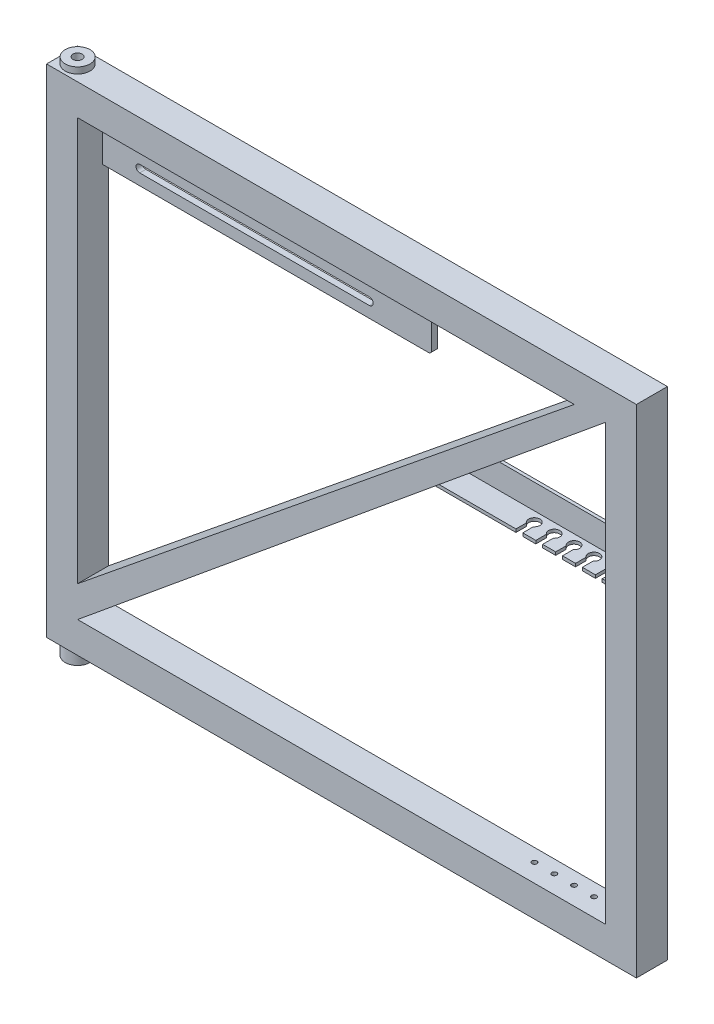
ISO-10303-21;
HEADER;
FILE_DESCRIPTION(('STEP AP214'),'2;1');
FILE_NAME('part.step','',(''),(''),'','','');
FILE_SCHEMA(('AUTOMOTIVE_DESIGN { 1 0 10303 214 1 1 1 1 }'));
ENDSEC;
DATA;
#1=APPLICATION_CONTEXT('core data for automotive mechanical design processes');
#2=APPLICATION_PROTOCOL_DEFINITION('international standard','automotive_design',2000,#1);
#3=PRODUCT_CONTEXT('',#1,'mechanical');
#4=PRODUCT('Part','Part','',(#3));
#5=PRODUCT_RELATED_PRODUCT_CATEGORY('part','',(#4));
#6=PRODUCT_DEFINITION_FORMATION('','',#4);
#7=PRODUCT_DEFINITION_CONTEXT('part definition',#1,'design');
#8=PRODUCT_DEFINITION('design','',#6,#7);
#9=PRODUCT_DEFINITION_SHAPE('','',#8);
#10=(LENGTH_UNIT() NAMED_UNIT(*) SI_UNIT(.MILLI.,.METRE.));
#11=(NAMED_UNIT(*) PLANE_ANGLE_UNIT() SI_UNIT($,.RADIAN.));
#12=(NAMED_UNIT(*) SI_UNIT($,.STERADIAN.) SOLID_ANGLE_UNIT());
#13=UNCERTAINTY_MEASURE_WITH_UNIT(LENGTH_MEASURE(1.E-05),#10,'distance_accuracy_value','');
#14=(GEOMETRIC_REPRESENTATION_CONTEXT(3) GLOBAL_UNCERTAINTY_ASSIGNED_CONTEXT((#13)) GLOBAL_UNIT_ASSIGNED_CONTEXT((#10,
#11,#12)) REPRESENTATION_CONTEXT('',''));
#15=CARTESIAN_POINT('',(0.,0.,0.));
#16=DIRECTION('',(0.,0.,1.));
#17=DIRECTION('',(1.,0.,0.));
#18=AXIS2_PLACEMENT_3D('',#15,#16,#17);
#19=CARTESIAN_POINT('',(0.,0.,50.));
#20=DIRECTION('',(0.,1.,0.));
#21=DIRECTION('',(0.,0.,1.));
#22=AXIS2_PLACEMENT_3D('',#19,#20,#21);
#23=PLANE('',#22);
#24=DIRECTION('',(1.,0.,0.));
#25=VECTOR('',#24,1.);
#26=CARTESIAN_POINT('',(0.,0.,0.));
#27=LINE('',#26,#25);
#28=CARTESIAN_POINT('',(0.,0.,0.));
#29=VERTEX_POINT('',#28);
#30=CARTESIAN_POINT('',(950.,0.,0.));
#31=VERTEX_POINT('',#30);
#32=EDGE_CURVE('E587',#29,#31,#27,.T.);
#33=ORIENTED_EDGE('',*,*,#32,.T.);
#34=DIRECTION('',(0.,0.,-1.));
#35=VECTOR('',#34,1.);
#36=CARTESIAN_POINT('',(950.,0.,50.));
#37=LINE('',#36,#35);
#38=CARTESIAN_POINT('',(950.,0.,50.));
#39=VERTEX_POINT('',#38);
#40=EDGE_CURVE('E608',#39,#31,#37,.T.);
#41=ORIENTED_EDGE('',*,*,#40,.F.);
#42=DIRECTION('',(1.,0.,0.));
#43=VECTOR('',#42,1.);
#44=CARTESIAN_POINT('',(0.,0.,50.));
#45=LINE('',#44,#43);
#46=CARTESIAN_POINT('',(0.,0.,50.));
#47=VERTEX_POINT('',#46);
#48=EDGE_CURVE('E596',#47,#39,#45,.T.);
#49=ORIENTED_EDGE('',*,*,#48,.F.);
#50=DIRECTION('',(0.,0.,-1.));
#51=VECTOR('',#50,1.);
#52=CARTESIAN_POINT('',(0.,0.,50.));
#53=LINE('',#52,#51);
#54=EDGE_CURVE('E611',#47,#29,#53,.T.);
#55=ORIENTED_EDGE('',*,*,#54,.T.);
#56=EDGE_LOOP('',(#33,#41,#49,#55));
#57=FACE_BOUND('',#56,.T.);
#58=CARTESIAN_POINT('',(25.,0.,25.));
#59=DIRECTION('',(0.,1.,0.));
#60=DIRECTION('',(0.,0.,1.));
#61=AXIS2_PLACEMENT_3D('',#58,#59,#60);
#62=CIRCLE('',#61,20.);
#63=CARTESIAN_POINT('',(25.,0.,45.));
#64=VERTEX_POINT('',#63);
#65=EDGE_CURVE('E11',#64,#64,#62,.F.);
#66=ORIENTED_EDGE('',*,*,#65,.F.);
#67=EDGE_LOOP('',(#66));
#68=FACE_BOUND('',#67,.T.);
#69=ADVANCED_FACE('F16',(#57,#68),#23,.F.);
#70=CARTESIAN_POINT('',(0.,800.,50.));
#71=DIRECTION('',(0.,-1.,0.));
#72=DIRECTION('',(0.,0.,-1.));
#73=AXIS2_PLACEMENT_3D('',#70,#71,#72);
#74=PLANE('',#73);
#75=DIRECTION('',(-1.,0.,0.));
#76=VECTOR('',#75,1.);
#77=CARTESIAN_POINT('',(0.,800.,0.));
#78=LINE('',#77,#76);
#79=CARTESIAN_POINT('',(950.,800.,0.));
#80=VERTEX_POINT('',#79);
#81=CARTESIAN_POINT('',(0.,800.,0.));
#82=VERTEX_POINT('',#81);
#83=EDGE_CURVE('E591',#80,#82,#78,.T.);
#84=ORIENTED_EDGE('',*,*,#83,.T.);
#85=DIRECTION('',(0.,0.,-1.));
#86=VECTOR('',#85,1.);
#87=CARTESIAN_POINT('',(0.,800.,50.));
#88=LINE('',#87,#86);
#89=CARTESIAN_POINT('',(0.,800.,50.));
#90=VERTEX_POINT('',#89);
#91=EDGE_CURVE('E602',#90,#82,#88,.T.);
#92=ORIENTED_EDGE('',*,*,#91,.F.);
#93=DIRECTION('',(-1.,0.,0.));
#94=VECTOR('',#93,1.);
#95=CARTESIAN_POINT('',(0.,800.,50.));
#96=LINE('',#95,#94);
#97=CARTESIAN_POINT('',(950.,800.,50.));
#98=VERTEX_POINT('',#97);
#99=EDGE_CURVE('E600',#98,#90,#96,.T.);
#100=ORIENTED_EDGE('',*,*,#99,.F.);
#101=DIRECTION('',(0.,0.,-1.));
#102=VECTOR('',#101,1.);
#103=CARTESIAN_POINT('',(950.,800.,50.));
#104=LINE('',#103,#102);
#105=EDGE_CURVE('E605',#98,#80,#104,.T.);
#106=ORIENTED_EDGE('',*,*,#105,.T.);
#107=EDGE_LOOP('',(#84,#92,#100,#106));
#108=FACE_BOUND('',#107,.T.);
#109=CARTESIAN_POINT('',(25.,800.,25.));
#110=DIRECTION('',(0.,-1.,0.));
#111=DIRECTION('',(0.,0.,-1.));
#112=AXIS2_PLACEMENT_3D('',#109,#110,#111);
#113=CIRCLE('',#112,20.);
#114=CARTESIAN_POINT('',(25.,800.,5.));
#115=VERTEX_POINT('',#114);
#116=EDGE_CURVE('E24',#115,#115,#113,.F.);
#117=ORIENTED_EDGE('',*,*,#116,.F.);
#118=EDGE_LOOP('',(#117));
#119=FACE_BOUND('',#118,.T.);
#120=ADVANCED_FACE('F626',(#108,#119),#74,.F.);
#121=CARTESIAN_POINT('',(900.,519.411764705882,45.));
#122=DIRECTION('',(0.,0.,1.));
#123=DIRECTION('',(1.,0.,0.));
#124=AXIS2_PLACEMENT_3D('',#121,#122,#123);
#125=PLANE('',#124);
#126=DIRECTION('',(0.,1.,0.));
#127=VECTOR('',#126,1.);
#128=CARTESIAN_POINT('',(751.,479.411764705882,45.));
#129=LINE('',#128,#127);
#130=CARTESIAN_POINT('',(751.,519.411764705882,45.));
#131=VERTEX_POINT('',#130);
#132=CARTESIAN_POINT('',(751.,524.411764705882,45.));
#133=VERTEX_POINT('',#132);
#134=EDGE_CURVE('E324',#131,#133,#129,.T.);
#135=ORIENTED_EDGE('',*,*,#134,.T.);
#136=DIRECTION('',(-1.,0.,0.));
#137=VECTOR('',#136,1.);
#138=CARTESIAN_POINT('',(900.,524.411764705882,45.));
#139=LINE('',#138,#137);
#140=CARTESIAN_POINT('',(626.071428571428,524.411764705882,45.));
#141=VERTEX_POINT('',#140);
#142=EDGE_CURVE('E439',#133,#141,#139,.T.);
#143=ORIENTED_EDGE('',*,*,#142,.T.);
#144=DIRECTION('',(-0.771930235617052,-0.635707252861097,0.));
#145=VECTOR('',#144,1.);
#146=CARTESIAN_POINT('',(626.071428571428,524.411764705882,45.));
#147=LINE('',#146,#145);
#148=CARTESIAN_POINT('',(620.,519.411764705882,45.));
#149=VERTEX_POINT('',#148);
#150=EDGE_CURVE('E443',#141,#149,#147,.T.);
#151=ORIENTED_EDGE('',*,*,#150,.T.);
#152=DIRECTION('',(1.,0.,0.));
#153=VECTOR('',#152,1.);
#154=CARTESIAN_POINT('',(620.,519.411764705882,45.));
#155=LINE('',#154,#153);
#156=EDGE_CURVE('E433',#149,#131,#155,.T.);
#157=ORIENTED_EDGE('',*,*,#156,.T.);
#158=EDGE_LOOP('',(#135,#143,#151,#157));
#159=FACE_BOUND('',#158,.T.);
#160=ADVANCED_FACE('F628',(#159),#125,.T.);
#161=DIRECTION('',(0.,1.,0.));
#162=VECTOR('',#161,1.);
#163=CARTESIAN_POINT('',(762.,479.411764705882,45.));
#164=LINE('',#163,#162);
#165=CARTESIAN_POINT('',(762.,519.411764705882,45.));
#166=VERTEX_POINT('',#165);
#167=CARTESIAN_POINT('',(762.,524.411764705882,45.));
#168=VERTEX_POINT('',#167);
#169=EDGE_CURVE('E31',#166,#168,#164,.T.);
#170=ORIENTED_EDGE('',*,*,#169,.F.);
#171=CARTESIAN_POINT('',(783.,519.411764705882,45.));
#172=VERTEX_POINT('',#171);
#173=EDGE_CURVE('E437',#166,#172,#155,.T.);
#174=ORIENTED_EDGE('',*,*,#173,.T.);
#175=DIRECTION('',(0.,1.,0.));
#176=VECTOR('',#175,1.);
#177=CARTESIAN_POINT('',(783.,479.411764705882,45.));
#178=LINE('',#177,#176);
#179=CARTESIAN_POINT('',(783.,524.411764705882,45.));
#180=VERTEX_POINT('',#179);
#181=EDGE_CURVE('E342',#172,#180,#178,.T.);
#182=ORIENTED_EDGE('',*,*,#181,.T.);
#183=EDGE_CURVE('E881',#180,#168,#139,.T.);
#184=ORIENTED_EDGE('',*,*,#183,.T.);
#185=EDGE_LOOP('',(#170,#174,#182,#184));
#186=FACE_BOUND('',#185,.T.);
#187=ADVANCED_FACE('F637',(#186),#125,.T.);
#188=DIRECTION('',(0.,1.,0.));
#189=VECTOR('',#188,1.);
#190=CARTESIAN_POINT('',(794.,479.411764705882,45.));
#191=LINE('',#190,#189);
#192=CARTESIAN_POINT('',(794.,519.411764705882,45.));
#193=VERTEX_POINT('',#192);
#194=CARTESIAN_POINT('',(794.,524.411764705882,45.));
#195=VERTEX_POINT('',#194);
#196=EDGE_CURVE('E39',#193,#195,#191,.T.);
#197=ORIENTED_EDGE('',*,*,#196,.F.);
#198=CARTESIAN_POINT('',(815.,519.411764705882,45.));
#199=VERTEX_POINT('',#198);
#200=EDGE_CURVE('E906',#193,#199,#155,.T.);
#201=ORIENTED_EDGE('',*,*,#200,.T.);
#202=DIRECTION('',(0.,1.,0.));
#203=VECTOR('',#202,1.);
#204=CARTESIAN_POINT('',(815.,479.411764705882,45.));
#205=LINE('',#204,#203);
#206=CARTESIAN_POINT('',(815.,524.411764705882,45.));
#207=VERTEX_POINT('',#206);
#208=EDGE_CURVE('E368',#199,#207,#205,.T.);
#209=ORIENTED_EDGE('',*,*,#208,.T.);
#210=EDGE_CURVE('E882',#207,#195,#139,.T.);
#211=ORIENTED_EDGE('',*,*,#210,.T.);
#212=EDGE_LOOP('',(#197,#201,#209,#211));
#213=FACE_BOUND('',#212,.T.);
#214=ADVANCED_FACE('F926',(#213),#125,.T.);
#215=DIRECTION('',(0.,1.,0.));
#216=VECTOR('',#215,1.);
#217=CARTESIAN_POINT('',(826.,479.411764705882,45.));
#218=LINE('',#217,#216);
#219=CARTESIAN_POINT('',(826.,519.411764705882,45.));
#220=VERTEX_POINT('',#219);
#221=CARTESIAN_POINT('',(826.,524.411764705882,45.));
#222=VERTEX_POINT('',#221);
#223=EDGE_CURVE('E367',#220,#222,#218,.T.);
#224=ORIENTED_EDGE('',*,*,#223,.F.);
#225=CARTESIAN_POINT('',(847.,519.411764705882,45.));
#226=VERTEX_POINT('',#225);
#227=EDGE_CURVE('E905',#220,#226,#155,.T.);
#228=ORIENTED_EDGE('',*,*,#227,.T.);
#229=DIRECTION('',(0.,1.,0.));
#230=VECTOR('',#229,1.);
#231=CARTESIAN_POINT('',(847.,479.411764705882,45.));
#232=LINE('',#231,#230);
#233=CARTESIAN_POINT('',(847.,524.411764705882,45.));
#234=VERTEX_POINT('',#233);
#235=EDGE_CURVE('E394',#226,#234,#232,.T.);
#236=ORIENTED_EDGE('',*,*,#235,.T.);
#237=EDGE_CURVE('E885',#234,#222,#139,.T.);
#238=ORIENTED_EDGE('',*,*,#237,.T.);
#239=EDGE_LOOP('',(#224,#228,#236,#238));
#240=FACE_BOUND('',#239,.T.);
#241=ADVANCED_FACE('F928',(#240),#125,.T.);
#242=DIRECTION('',(0.,1.,0.));
#243=VECTOR('',#242,1.);
#244=CARTESIAN_POINT('',(858.,479.411764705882,45.));
#245=LINE('',#244,#243);
#246=CARTESIAN_POINT('',(858.,519.411764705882,45.));
#247=VERTEX_POINT('',#246);
#248=CARTESIAN_POINT('',(858.,524.411764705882,45.));
#249=VERTEX_POINT('',#248);
#250=EDGE_CURVE('E393',#247,#249,#245,.T.);
#251=ORIENTED_EDGE('',*,*,#250,.F.);
#252=CARTESIAN_POINT('',(879.,519.411764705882,45.));
#253=VERTEX_POINT('',#252);
#254=EDGE_CURVE('E904',#247,#253,#155,.T.);
#255=ORIENTED_EDGE('',*,*,#254,.T.);
#256=DIRECTION('',(0.,-1.,0.));
#257=VECTOR('',#256,1.);
#258=CARTESIAN_POINT('',(879.,519.411764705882,45.));
#259=LINE('',#258,#257);
#260=CARTESIAN_POINT('',(879.,524.411764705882,45.));
#261=VERTEX_POINT('',#260);
#262=EDGE_CURVE('E619',#261,#253,#259,.T.);
#263=ORIENTED_EDGE('',*,*,#262,.F.);
#264=EDGE_CURVE('E444',#261,#249,#139,.T.);
#265=ORIENTED_EDGE('',*,*,#264,.T.);
#266=EDGE_LOOP('',(#251,#255,#263,#265));
#267=FACE_BOUND('',#266,.T.);
#268=ADVANCED_FACE('F756',(#267),#125,.T.);
#269=CARTESIAN_POINT('',(900.,50.,50.));
#270=DIRECTION('',(-1.,0.,0.));
#271=DIRECTION('',(0.,0.,1.));
#272=AXIS2_PLACEMENT_3D('',#269,#270,#271);
#273=PLANE('',#272);
#274=DIRECTION('',(0.,1.,0.));
#275=VECTOR('',#274,1.);
#276=CARTESIAN_POINT('',(900.,519.411764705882,45.));
#277=LINE('',#276,#275);
#278=CARTESIAN_POINT('',(900.,519.411764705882,45.));
#279=VERTEX_POINT('',#278);
#280=CARTESIAN_POINT('',(900.,524.411764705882,45.));
#281=VERTEX_POINT('',#280);
#282=EDGE_CURVE('E436',#279,#281,#277,.T.);
#283=ORIENTED_EDGE('',*,*,#282,.F.);
#284=DIRECTION('',(0.,0.,-1.));
#285=VECTOR('',#284,1.);
#286=CARTESIAN_POINT('',(900.,519.411764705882,5.));
#287=LINE('',#286,#285);
#288=CARTESIAN_POINT('',(900.,519.411764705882,0.));
#289=VERTEX_POINT('',#288);
#290=EDGE_CURVE('E463',#279,#289,#287,.T.);
#291=ORIENTED_EDGE('',*,*,#290,.T.);
#292=DIRECTION('',(0.,1.,0.));
#293=VECTOR('',#292,1.);
#294=CARTESIAN_POINT('',(900.,50.,0.));
#295=LINE('',#294,#293);
#296=CARTESIAN_POINT('',(900.,50.,0.));
#297=VERTEX_POINT('',#296);
#298=EDGE_CURVE('E561',#297,#289,#295,.T.);
#299=ORIENTED_EDGE('',*,*,#298,.F.);
#300=DIRECTION('',(0.,0.,-1.));
#301=VECTOR('',#300,1.);
#302=CARTESIAN_POINT('',(900.,50.,50.));
#303=LINE('',#302,#301);
#304=CARTESIAN_POINT('',(900.,50.,50.));
#305=VERTEX_POINT('',#304);
#306=EDGE_CURVE('E581',#305,#297,#303,.T.);
#307=ORIENTED_EDGE('',*,*,#306,.F.);
#308=DIRECTION('',(0.,1.,0.));
#309=VECTOR('',#308,1.);
#310=CARTESIAN_POINT('',(900.,50.,50.));
#311=LINE('',#310,#309);
#312=CARTESIAN_POINT('',(900.,750.,50.));
#313=VERTEX_POINT('',#312);
#314=EDGE_CURVE('E570',#305,#313,#311,.T.);
#315=ORIENTED_EDGE('',*,*,#314,.T.);
#316=DIRECTION('',(0.,0.,-1.));
#317=VECTOR('',#316,1.);
#318=CARTESIAN_POINT('',(900.,750.,50.));
#319=LINE('',#318,#317);
#320=CARTESIAN_POINT('',(900.,750.,0.));
#321=VERTEX_POINT('',#320);
#322=EDGE_CURVE('E578',#313,#321,#319,.T.);
#323=ORIENTED_EDGE('',*,*,#322,.T.);
#324=CARTESIAN_POINT('',(900.,564.411764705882,0.));
#325=VERTEX_POINT('',#324);
#326=EDGE_CURVE('E560',#325,#321,#295,.T.);
#327=ORIENTED_EDGE('',*,*,#326,.F.);
#328=DIRECTION('',(0.,0.,-1.));
#329=VECTOR('',#328,1.);
#330=CARTESIAN_POINT('',(900.,564.411764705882,5.));
#331=LINE('',#330,#329);
#332=CARTESIAN_POINT('',(900.,564.411764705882,5.));
#333=VERTEX_POINT('',#332);
#334=EDGE_CURVE('E472',#333,#325,#331,.T.);
#335=ORIENTED_EDGE('',*,*,#334,.F.);
#336=DIRECTION('',(0.,1.,0.));
#337=VECTOR('',#336,1.);
#338=CARTESIAN_POINT('',(900.,519.411764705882,5.));
#339=LINE('',#338,#337);
#340=CARTESIAN_POINT('',(900.,524.411764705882,5.));
#341=VERTEX_POINT('',#340);
#342=EDGE_CURVE('E456',#341,#333,#339,.T.);
#343=ORIENTED_EDGE('',*,*,#342,.F.);
#344=DIRECTION('',(0.,0.,-1.));
#345=VECTOR('',#344,1.);
#346=CARTESIAN_POINT('',(900.,524.411764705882,45.));
#347=LINE('',#346,#345);
#348=EDGE_CURVE('E450',#281,#341,#347,.T.);
#349=ORIENTED_EDGE('',*,*,#348,.F.);
#350=EDGE_LOOP('',(#283,#291,#299,#307,#315,#323,#327,#335,#343,#349));
#351=FACE_BOUND('',#350,.T.);
#352=ADVANCED_FACE('F817',(#351),#273,.T.);
#353=CARTESIAN_POINT('',(900.,750.,50.));
#354=DIRECTION('',(0.6357072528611,-0.77193023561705,0.));
#355=DIRECTION('',(0.77193023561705,0.6357072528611,0.));
#356=AXIS2_PLACEMENT_3D('',#353,#354,#355);
#357=PLANE('',#356);
#358=DIRECTION('',(0.,0.,-1.));
#359=VECTOR('',#358,1.);
#360=CARTESIAN_POINT('',(620.,519.411764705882,5.));
#361=LINE('',#360,#359);
#362=CARTESIAN_POINT('',(620.,519.411764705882,0.));
#363=VERTEX_POINT('',#362);
#364=EDGE_CURVE('E466',#149,#363,#361,.T.);
#365=ORIENTED_EDGE('',*,*,#364,.F.);
#366=ORIENTED_EDGE('',*,*,#150,.F.);
#367=DIRECTION('',(0.,0.,-1.));
#368=VECTOR('',#367,1.);
#369=CARTESIAN_POINT('',(626.071428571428,524.411764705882,45.));
#370=LINE('',#369,#368);
#371=CARTESIAN_POINT('',(626.071428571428,524.411764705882,5.));
#372=VERTEX_POINT('',#371);
#373=EDGE_CURVE('E447',#141,#372,#370,.T.);
#374=ORIENTED_EDGE('',*,*,#373,.T.);
#375=DIRECTION('',(-0.771930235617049,-0.635707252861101,0.));
#376=VECTOR('',#375,1.);
#377=CARTESIAN_POINT('',(674.642857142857,564.411764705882,5.));
#378=LINE('',#377,#376);
#379=CARTESIAN_POINT('',(674.642857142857,564.411764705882,5.));
#380=VERTEX_POINT('',#379);
#381=EDGE_CURVE('E460',#380,#372,#378,.T.);
#382=ORIENTED_EDGE('',*,*,#381,.F.);
#383=DIRECTION('',(0.,0.,-1.));
#384=VECTOR('',#383,1.);
#385=CARTESIAN_POINT('',(674.642857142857,564.411764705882,5.));
#386=LINE('',#385,#384);
#387=CARTESIAN_POINT('',(674.642857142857,564.411764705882,0.));
#388=VERTEX_POINT('',#387);
#389=EDGE_CURVE('E469',#380,#388,#386,.T.);
#390=ORIENTED_EDGE('',*,*,#389,.T.);
#391=DIRECTION('',(-0.77193023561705,-0.6357072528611,0.));
#392=VECTOR('',#391,1.);
#393=CARTESIAN_POINT('',(900.,750.,0.));
#394=LINE('',#393,#392);
#395=EDGE_CURVE('E565',#321,#388,#394,.T.);
#396=ORIENTED_EDGE('',*,*,#395,.F.);
#397=ORIENTED_EDGE('',*,*,#322,.F.);
#398=DIRECTION('',(-0.77193023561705,-0.6357072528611,0.));
#399=VECTOR('',#398,1.);
#400=CARTESIAN_POINT('',(900.,750.,50.));
#401=LINE('',#400,#399);
#402=CARTESIAN_POINT('',(50.,50.,50.));
#403=VERTEX_POINT('',#402);
#404=EDGE_CURVE('E573',#313,#403,#401,.T.);
#405=ORIENTED_EDGE('',*,*,#404,.T.);
#406=DIRECTION('',(0.,0.,-1.));
#407=VECTOR('',#406,1.);
#408=CARTESIAN_POINT('',(50.,50.,50.));
#409=LINE('',#408,#407);
#410=CARTESIAN_POINT('',(50.,50.,0.));
#411=VERTEX_POINT('',#410);
#412=EDGE_CURVE('E575',#403,#411,#409,.T.);
#413=ORIENTED_EDGE('',*,*,#412,.T.);
#414=EDGE_CURVE('E564',#363,#411,#394,.T.);
#415=ORIENTED_EDGE('',*,*,#414,.F.);
#416=EDGE_LOOP('',(#365,#366,#374,#382,#390,#396,#397,#405,#413,#415));
#417=FACE_BOUND('',#416,.T.);
#418=ADVANCED_FACE('F763',(#417),#357,.T.);
#419=CARTESIAN_POINT('',(900.,564.411764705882,5.));
#420=DIRECTION('',(0.,0.,1.));
#421=DIRECTION('',(1.,0.,0.));
#422=AXIS2_PLACEMENT_3D('',#419,#420,#421);
#423=PLANE('',#422);
#424=ORIENTED_EDGE('',*,*,#381,.T.);
#425=DIRECTION('',(1.,0.,0.));
#426=VECTOR('',#425,1.);
#427=CARTESIAN_POINT('',(900.,524.411764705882,5.));
#428=LINE('',#427,#426);
#429=EDGE_CURVE('E614',#372,#341,#428,.T.);
#430=ORIENTED_EDGE('',*,*,#429,.T.);
#431=ORIENTED_EDGE('',*,*,#342,.T.);
#432=DIRECTION('',(-1.,0.,0.));
#433=VECTOR('',#432,1.);
#434=CARTESIAN_POINT('',(900.,564.411764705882,5.));
#435=LINE('',#434,#433);
#436=EDGE_CURVE('E458',#333,#380,#435,.T.);
#437=ORIENTED_EDGE('',*,*,#436,.T.);
#438=EDGE_LOOP('',(#424,#430,#431,#437));
#439=FACE_BOUND('',#438,.T.);
#440=ADVANCED_FACE('F760',(#439),#423,.T.);
#441=CARTESIAN_POINT('',(0.,800.,50.));
#442=DIRECTION('',(0.,0.,-1.));
#443=DIRECTION('',(-1.,0.,0.));
#444=AXIS2_PLACEMENT_3D('',#441,#442,#443);
#445=PLANE('',#444);
#446=DIRECTION('',(1.,0.,0.));
#447=VECTOR('',#446,1.);
#448=CARTESIAN_POINT('',(50.,50.,50.));
#449=LINE('',#448,#447);
#450=EDGE_CURVE('E568',#403,#305,#449,.T.);
#451=ORIENTED_EDGE('',*,*,#450,.F.);
#452=ORIENTED_EDGE('',*,*,#404,.F.);
#453=ORIENTED_EDGE('',*,*,#314,.F.);
#454=EDGE_LOOP('',(#451,#452,#453));
#455=FACE_BOUND('',#454,.T.);
#456=DIRECTION('',(0.,-1.,0.));
#457=VECTOR('',#456,1.);
#458=CARTESIAN_POINT('',(0.,0.,50.));
#459=LINE('',#458,#457);
#460=EDGE_CURVE('E593',#90,#47,#459,.T.);
#461=ORIENTED_EDGE('',*,*,#460,.T.);
#462=ORIENTED_EDGE('',*,*,#48,.T.);
#463=DIRECTION('',(0.,1.,0.));
#464=VECTOR('',#463,1.);
#465=CARTESIAN_POINT('',(950.,0.,50.));
#466=LINE('',#465,#464);
#467=EDGE_CURVE('E598',#39,#98,#466,.T.);
#468=ORIENTED_EDGE('',*,*,#467,.T.);
#469=ORIENTED_EDGE('',*,*,#99,.T.);
#470=EDGE_LOOP('',(#461,#462,#468,#469));
#471=FACE_BOUND('',#470,.T.);
#472=DIRECTION('',(-1.,0.,0.));
#473=VECTOR('',#472,1.);
#474=CARTESIAN_POINT('',(50.,750.,50.));
#475=LINE('',#474,#473);
#476=CARTESIAN_POINT('',(850.,750.,50.));
#477=VERTEX_POINT('',#476);
#478=CARTESIAN_POINT('',(50.,750.,50.));
#479=VERTEX_POINT('',#478);
#480=EDGE_CURVE('E541',#477,#479,#475,.T.);
#481=ORIENTED_EDGE('',*,*,#480,.F.);
#482=DIRECTION('',(0.776114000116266,0.630592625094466,0.));
#483=VECTOR('',#482,1.);
#484=CARTESIAN_POINT('',(850.,750.,50.));
#485=LINE('',#484,#483);
#486=CARTESIAN_POINT('',(50.,100.,50.));
#487=VERTEX_POINT('',#486);
#488=EDGE_CURVE('E546',#487,#477,#485,.T.);
#489=ORIENTED_EDGE('',*,*,#488,.F.);
#490=DIRECTION('',(0.,-1.,0.));
#491=VECTOR('',#490,1.);
#492=CARTESIAN_POINT('',(50.,100.,50.));
#493=LINE('',#492,#491);
#494=EDGE_CURVE('E543',#479,#487,#493,.T.);
#495=ORIENTED_EDGE('',*,*,#494,.F.);
#496=EDGE_LOOP('',(#481,#489,#495));
#497=FACE_BOUND('',#496,.T.);
#498=ADVANCED_FACE('F644',(#455,#471,#497),#445,.F.);
#499=CARTESIAN_POINT('',(0.,800.,0.));
#500=DIRECTION('',(0.,0.,-1.));
#501=DIRECTION('',(-1.,0.,0.));
#502=AXIS2_PLACEMENT_3D('',#499,#500,#501);
#503=PLANE('',#502);
#504=ORIENTED_EDGE('',*,*,#298,.T.);
#505=DIRECTION('',(1.,0.,0.));
#506=VECTOR('',#505,1.);
#507=CARTESIAN_POINT('',(620.,519.411764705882,0.));
#508=LINE('',#507,#506);
#509=EDGE_CURVE('E454',#363,#289,#508,.T.);
#510=ORIENTED_EDGE('',*,*,#509,.F.);
#511=ORIENTED_EDGE('',*,*,#414,.T.);
#512=DIRECTION('',(1.,0.,0.));
#513=VECTOR('',#512,1.);
#514=CARTESIAN_POINT('',(50.,50.,0.));
#515=LINE('',#514,#513);
#516=EDGE_CURVE('E557',#411,#297,#515,.T.);
#517=ORIENTED_EDGE('',*,*,#516,.T.);
#518=EDGE_LOOP('',(#504,#510,#511,#517));
#519=FACE_BOUND('',#518,.T.);
#520=CARTESIAN_POINT('',(480.,689.,0.));
#521=DIRECTION('',(0.,0.,1.));
#522=DIRECTION('',(1.,0.,0.));
#523=AXIS2_PLACEMENT_3D('',#520,#521,#522);
#524=CIRCLE('',#523,6.);
#525=CARTESIAN_POINT('',(480.,683.,0.));
#526=VERTEX_POINT('',#525);
#527=CARTESIAN_POINT('',(480.,695.,0.));
#528=VERTEX_POINT('',#527);
#529=EDGE_CURVE('E474',#526,#528,#524,.T.);
#530=ORIENTED_EDGE('',*,*,#529,.T.);
#531=DIRECTION('',(-1.,0.,0.));
#532=VECTOR('',#531,1.);
#533=CARTESIAN_POINT('',(480.,695.,0.));
#534=LINE('',#533,#532);
#535=CARTESIAN_POINT('',(110.,695.,0.));
#536=VERTEX_POINT('',#535);
#537=EDGE_CURVE('E477',#528,#536,#534,.T.);
#538=ORIENTED_EDGE('',*,*,#537,.T.);
#539=CARTESIAN_POINT('',(110.,689.,0.));
#540=DIRECTION('',(0.,0.,1.));
#541=DIRECTION('',(1.,0.,0.));
#542=AXIS2_PLACEMENT_3D('',#539,#540,#541);
#543=CIRCLE('',#542,6.);
#544=CARTESIAN_POINT('',(110.,683.,0.));
#545=VERTEX_POINT('',#544);
#546=EDGE_CURVE('E480',#536,#545,#543,.T.);
#547=ORIENTED_EDGE('',*,*,#546,.T.);
#548=DIRECTION('',(1.,0.,0.));
#549=VECTOR('',#548,1.);
#550=CARTESIAN_POINT('',(480.,683.,0.));
#551=LINE('',#550,#549);
#552=EDGE_CURVE('E483',#545,#526,#551,.T.);
#553=ORIENTED_EDGE('',*,*,#552,.T.);
#554=EDGE_LOOP('',(#530,#538,#547,#553));
#555=FACE_BOUND('',#554,.T.);
#556=DIRECTION('',(0.776114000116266,0.630592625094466,0.));
#557=VECTOR('',#556,1.);
#558=CARTESIAN_POINT('',(850.,750.,0.));
#559=LINE('',#558,#557);
#560=CARTESIAN_POINT('',(50.,100.,0.));
#561=VERTEX_POINT('',#560);
#562=CARTESIAN_POINT('',(850.,750.,0.));
#563=VERTEX_POINT('',#562);
#564=EDGE_CURVE('E538',#561,#563,#559,.T.);
#565=ORIENTED_EDGE('',*,*,#564,.T.);
#566=DIRECTION('',(-1.,0.,0.));
#567=VECTOR('',#566,1.);
#568=CARTESIAN_POINT('',(50.,750.,0.));
#569=LINE('',#568,#567);
#570=CARTESIAN_POINT('',(580.,750.,0.));
#571=VERTEX_POINT('',#570);
#572=EDGE_CURVE('E533',#563,#571,#569,.T.);
#573=ORIENTED_EDGE('',*,*,#572,.T.);
#574=DIRECTION('',(0.,1.,0.));
#575=VECTOR('',#574,1.);
#576=CARTESIAN_POINT('',(580.,750.,0.));
#577=LINE('',#576,#575);
#578=CARTESIAN_POINT('',(580.,668.,0.));
#579=VERTEX_POINT('',#578);
#580=EDGE_CURVE('E509',#579,#571,#577,.T.);
#581=ORIENTED_EDGE('',*,*,#580,.F.);
#582=DIRECTION('',(0.707106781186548,0.707106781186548,0.));
#583=VECTOR('',#582,1.);
#584=CARTESIAN_POINT('',(580.,668.,0.));
#585=LINE('',#584,#583);
#586=CARTESIAN_POINT('',(577.,665.,0.));
#587=VERTEX_POINT('',#586);
#588=EDGE_CURVE('E507',#587,#579,#585,.T.);
#589=ORIENTED_EDGE('',*,*,#588,.F.);
#590=DIRECTION('',(1.,0.,0.));
#591=VECTOR('',#590,1.);
#592=CARTESIAN_POINT('',(50.,665.,0.));
#593=LINE('',#592,#591);
#594=CARTESIAN_POINT('',(50.,665.,0.));
#595=VERTEX_POINT('',#594);
#596=EDGE_CURVE('E505',#595,#587,#593,.T.);
#597=ORIENTED_EDGE('',*,*,#596,.F.);
#598=DIRECTION('',(0.,-1.,0.));
#599=VECTOR('',#598,1.);
#600=CARTESIAN_POINT('',(50.,100.,0.));
#601=LINE('',#600,#599);
#602=EDGE_CURVE('E536',#595,#561,#601,.T.);
#603=ORIENTED_EDGE('',*,*,#602,.T.);
#604=EDGE_LOOP('',(#565,#573,#581,#589,#597,#603));
#605=FACE_BOUND('',#604,.T.);
#606=DIRECTION('',(0.,-1.,0.));
#607=VECTOR('',#606,1.);
#608=CARTESIAN_POINT('',(0.,0.,0.));
#609=LINE('',#608,#607);
#610=EDGE_CURVE('E584',#82,#29,#609,.T.);
#611=ORIENTED_EDGE('',*,*,#610,.F.);
#612=ORIENTED_EDGE('',*,*,#83,.F.);
#613=DIRECTION('',(0.,1.,0.));
#614=VECTOR('',#613,1.);
#615=CARTESIAN_POINT('',(950.,0.,0.));
#616=LINE('',#615,#614);
#617=EDGE_CURVE('E589',#31,#80,#616,.T.);
#618=ORIENTED_EDGE('',*,*,#617,.F.);
#619=ORIENTED_EDGE('',*,*,#32,.F.);
#620=EDGE_LOOP('',(#611,#612,#618,#619));
#621=FACE_BOUND('',#620,.T.);
#622=DIRECTION('',(-1.,0.,0.));
#623=VECTOR('',#622,1.);
#624=CARTESIAN_POINT('',(900.,564.411764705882,0.));
#625=LINE('',#624,#623);
#626=EDGE_CURVE('E452',#325,#388,#625,.T.);
#627=ORIENTED_EDGE('',*,*,#626,.F.);
#628=ORIENTED_EDGE('',*,*,#326,.T.);
#629=ORIENTED_EDGE('',*,*,#395,.T.);
#630=EDGE_LOOP('',(#627,#628,#629));
#631=FACE_BOUND('',#630,.T.);
#632=ADVANCED_FACE('F658',(#519,#555,#605,#621,#631),#503,.T.);
#633=CARTESIAN_POINT('',(0.,0.,50.));
#634=DIRECTION('',(1.,0.,0.));
#635=DIRECTION('',(0.,0.,-1.));
#636=AXIS2_PLACEMENT_3D('',#633,#634,#635);
#637=PLANE('',#636);
#638=ORIENTED_EDGE('',*,*,#610,.T.);
#639=ORIENTED_EDGE('',*,*,#54,.F.);
#640=ORIENTED_EDGE('',*,*,#460,.F.);
#641=ORIENTED_EDGE('',*,*,#91,.T.);
#642=EDGE_LOOP('',(#638,#639,#640,#641));
#643=FACE_BOUND('',#642,.T.);
#644=ADVANCED_FACE('F18',(#643),#637,.F.);
#645=CARTESIAN_POINT('',(950.,0.,50.));
#646=DIRECTION('',(-1.,0.,0.));
#647=DIRECTION('',(0.,0.,1.));
#648=AXIS2_PLACEMENT_3D('',#645,#646,#647);
#649=PLANE('',#648);
#650=ORIENTED_EDGE('',*,*,#617,.T.);
#651=ORIENTED_EDGE('',*,*,#105,.F.);
#652=ORIENTED_EDGE('',*,*,#467,.F.);
#653=ORIENTED_EDGE('',*,*,#40,.T.);
#654=EDGE_LOOP('',(#650,#651,#652,#653));
#655=FACE_BOUND('',#654,.T.);
#656=ADVANCED_FACE('F646',(#655),#649,.F.);
#657=CARTESIAN_POINT('',(50.,50.,50.));
#658=DIRECTION('',(0.,1.,0.));
#659=DIRECTION('',(0.,0.,1.));
#660=AXIS2_PLACEMENT_3D('',#657,#658,#659);
#661=PLANE('',#660);
#662=CARTESIAN_POINT('',(884.519970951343,50.,20.7962127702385));
#663=DIRECTION('',(0.,1.,0.));
#664=DIRECTION('',(0.,0.,1.));
#665=AXIS2_PLACEMENT_3D('',#662,#663,#664);
#666=CIRCLE('',#665,4.);
#667=CARTESIAN_POINT('',(884.519970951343,50.,24.7962127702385));
#668=VERTEX_POINT('',#667);
#669=EDGE_CURVE('E1332',#668,#668,#666,.T.);
#670=ORIENTED_EDGE('',*,*,#669,.F.);
#671=EDGE_LOOP('',(#670));
#672=FACE_BOUND('',#671,.T.);
#673=CARTESIAN_POINT('',(852.519970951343,50.,20.7962127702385));
#674=DIRECTION('',(0.,1.,0.));
#675=DIRECTION('',(0.,0.,1.));
#676=AXIS2_PLACEMENT_3D('',#673,#674,#675);
#677=CIRCLE('',#676,4.);
#678=CARTESIAN_POINT('',(852.519970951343,50.,24.7962127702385));
#679=VERTEX_POINT('',#678);
#680=EDGE_CURVE('E1331',#679,#679,#677,.T.);
#681=ORIENTED_EDGE('',*,*,#680,.F.);
#682=EDGE_LOOP('',(#681));
#683=FACE_BOUND('',#682,.T.);
#684=CARTESIAN_POINT('',(820.519970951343,50.,20.7962127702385));
#685=DIRECTION('',(0.,1.,0.));
#686=DIRECTION('',(0.,0.,1.));
#687=AXIS2_PLACEMENT_3D('',#684,#685,#686);
#688=CIRCLE('',#687,4.);
#689=CARTESIAN_POINT('',(820.519970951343,50.,24.7962127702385));
#690=VERTEX_POINT('',#689);
#691=EDGE_CURVE('E1342',#690,#690,#688,.T.);
#692=ORIENTED_EDGE('',*,*,#691,.F.);
#693=EDGE_LOOP('',(#692));
#694=FACE_BOUND('',#693,.T.);
#695=CARTESIAN_POINT('',(788.519970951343,50.,20.7962127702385));
#696=DIRECTION('',(0.,1.,0.));
#697=DIRECTION('',(0.,0.,1.));
#698=AXIS2_PLACEMENT_3D('',#695,#696,#697);
#699=CIRCLE('',#698,4.);
#700=CARTESIAN_POINT('',(788.519970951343,50.,24.7962127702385));
#701=VERTEX_POINT('',#700);
#702=EDGE_CURVE('E1348',#701,#701,#699,.T.);
#703=ORIENTED_EDGE('',*,*,#702,.F.);
#704=EDGE_LOOP('',(#703));
#705=FACE_BOUND('',#704,.T.);
#706=CARTESIAN_POINT('',(756.519970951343,50.,20.7962127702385));
#707=DIRECTION('',(0.,1.,0.));
#708=DIRECTION('',(0.,0.,1.));
#709=AXIS2_PLACEMENT_3D('',#706,#707,#708);
#710=CIRCLE('',#709,4.);
#711=CARTESIAN_POINT('',(756.519970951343,50.,24.7962127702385));
#712=VERTEX_POINT('',#711);
#713=EDGE_CURVE('E1354',#712,#712,#710,.T.);
#714=ORIENTED_EDGE('',*,*,#713,.F.);
#715=EDGE_LOOP('',(#714));
#716=FACE_BOUND('',#715,.T.);
#717=ORIENTED_EDGE('',*,*,#516,.F.);
#718=ORIENTED_EDGE('',*,*,#412,.F.);
#719=ORIENTED_EDGE('',*,*,#450,.T.);
#720=ORIENTED_EDGE('',*,*,#306,.T.);
#721=EDGE_LOOP('',(#717,#718,#719,#720));
#722=FACE_BOUND('',#721,.T.);
#723=ADVANCED_FACE('F648',(#672,#683,#694,#705,#716,#722),#661,.T.);
#724=CARTESIAN_POINT('',(50.,750.,50.));
#725=DIRECTION('',(0.,-1.,0.));
#726=DIRECTION('',(0.,0.,-1.));
#727=AXIS2_PLACEMENT_3D('',#724,#725,#726);
#728=PLANE('',#727);
#729=DIRECTION('',(-1.,0.,0.));
#730=VECTOR('',#729,1.);
#731=CARTESIAN_POINT('',(50.,750.,10.));
#732=LINE('',#731,#730);
#733=CARTESIAN_POINT('',(580.,750.,10.));
#734=VERTEX_POINT('',#733);
#735=CARTESIAN_POINT('',(50.,750.,10.));
#736=VERTEX_POINT('',#735);
#737=EDGE_CURVE('E519',#734,#736,#732,.T.);
#738=ORIENTED_EDGE('',*,*,#737,.F.);
#739=DIRECTION('',(0.,0.,-1.));
#740=VECTOR('',#739,1.);
#741=CARTESIAN_POINT('',(580.,750.,10.));
#742=LINE('',#741,#740);
#743=EDGE_CURVE('E521',#734,#571,#742,.T.);
#744=ORIENTED_EDGE('',*,*,#743,.T.);
#745=ORIENTED_EDGE('',*,*,#572,.F.);
#746=DIRECTION('',(0.,0.,-1.));
#747=VECTOR('',#746,1.);
#748=CARTESIAN_POINT('',(850.,750.,50.));
#749=LINE('',#748,#747);
#750=EDGE_CURVE('E548',#477,#563,#749,.T.);
#751=ORIENTED_EDGE('',*,*,#750,.F.);
#752=ORIENTED_EDGE('',*,*,#480,.T.);
#753=DIRECTION('',(0.,0.,-1.));
#754=VECTOR('',#753,1.);
#755=CARTESIAN_POINT('',(50.,750.,50.));
#756=LINE('',#755,#754);
#757=EDGE_CURVE('E554',#479,#736,#756,.T.);
#758=ORIENTED_EDGE('',*,*,#757,.T.);
#759=EDGE_LOOP('',(#738,#744,#745,#751,#752,#758));
#760=FACE_BOUND('',#759,.T.);
#761=ADVANCED_FACE('F655',(#760),#728,.T.);
#762=CARTESIAN_POINT('',(50.,100.,50.));
#763=DIRECTION('',(1.,0.,0.));
#764=DIRECTION('',(0.,0.,-1.));
#765=AXIS2_PLACEMENT_3D('',#762,#763,#764);
#766=PLANE('',#765);
#767=DIRECTION('',(0.,-1.,0.));
#768=VECTOR('',#767,1.);
#769=CARTESIAN_POINT('',(50.,750.,10.));
#770=LINE('',#769,#768);
#771=CARTESIAN_POINT('',(50.,665.,10.));
#772=VERTEX_POINT('',#771);
#773=EDGE_CURVE('E511',#736,#772,#770,.T.);
#774=ORIENTED_EDGE('',*,*,#773,.F.);
#775=ORIENTED_EDGE('',*,*,#757,.F.);
#776=ORIENTED_EDGE('',*,*,#494,.T.);
#777=DIRECTION('',(0.,0.,-1.));
#778=VECTOR('',#777,1.);
#779=CARTESIAN_POINT('',(50.,100.,50.));
#780=LINE('',#779,#778);
#781=EDGE_CURVE('E551',#487,#561,#780,.T.);
#782=ORIENTED_EDGE('',*,*,#781,.T.);
#783=ORIENTED_EDGE('',*,*,#602,.F.);
#784=DIRECTION('',(0.,0.,-1.));
#785=VECTOR('',#784,1.);
#786=CARTESIAN_POINT('',(50.,665.,10.));
#787=LINE('',#786,#785);
#788=EDGE_CURVE('E530',#772,#595,#787,.T.);
#789=ORIENTED_EDGE('',*,*,#788,.F.);
#790=EDGE_LOOP('',(#774,#775,#776,#782,#783,#789));
#791=FACE_BOUND('',#790,.T.);
#792=ADVANCED_FACE('F807',(#791),#766,.T.);
#793=CARTESIAN_POINT('',(850.,750.,50.));
#794=DIRECTION('',(-0.630592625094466,0.776114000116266,0.));
#795=DIRECTION('',(-0.776114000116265,-0.630592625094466,0.));
#796=AXIS2_PLACEMENT_3D('',#793,#794,#795);
#797=PLANE('',#796);
#798=ORIENTED_EDGE('',*,*,#564,.F.);
#799=ORIENTED_EDGE('',*,*,#781,.F.);
#800=ORIENTED_EDGE('',*,*,#488,.T.);
#801=ORIENTED_EDGE('',*,*,#750,.T.);
#802=EDGE_LOOP('',(#798,#799,#800,#801));
#803=FACE_BOUND('',#802,.T.);
#804=ADVANCED_FACE('F793',(#803),#797,.T.);
#805=CARTESIAN_POINT('',(50.,665.,10.));
#806=DIRECTION('',(0.,0.,1.));
#807=DIRECTION('',(1.,0.,0.));
#808=AXIS2_PLACEMENT_3D('',#805,#806,#807);
#809=PLANE('',#808);
#810=ORIENTED_EDGE('',*,*,#773,.T.);
#811=DIRECTION('',(1.,0.,0.));
#812=VECTOR('',#811,1.);
#813=CARTESIAN_POINT('',(50.,665.,10.));
#814=LINE('',#813,#812);
#815=CARTESIAN_POINT('',(577.,665.,10.));
#816=VERTEX_POINT('',#815);
#817=EDGE_CURVE('E513',#772,#816,#814,.T.);
#818=ORIENTED_EDGE('',*,*,#817,.T.);
#819=DIRECTION('',(0.707106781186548,0.707106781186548,0.));
#820=VECTOR('',#819,1.);
#821=CARTESIAN_POINT('',(580.,668.,10.));
#822=LINE('',#821,#820);
#823=CARTESIAN_POINT('',(580.,668.,10.));
#824=VERTEX_POINT('',#823);
#825=EDGE_CURVE('E515',#816,#824,#822,.T.);
#826=ORIENTED_EDGE('',*,*,#825,.T.);
#827=DIRECTION('',(0.,1.,0.));
#828=VECTOR('',#827,1.);
#829=CARTESIAN_POINT('',(580.,750.,10.));
#830=LINE('',#829,#828);
#831=EDGE_CURVE('E517',#824,#734,#830,.T.);
#832=ORIENTED_EDGE('',*,*,#831,.T.);
#833=ORIENTED_EDGE('',*,*,#737,.T.);
#834=EDGE_LOOP('',(#810,#818,#826,#832,#833));
#835=FACE_BOUND('',#834,.T.);
#836=DIRECTION('',(-1.,0.,0.));
#837=VECTOR('',#836,1.);
#838=CARTESIAN_POINT('',(480.,695.,10.));
#839=LINE('',#838,#837);
#840=CARTESIAN_POINT('',(480.,695.,10.));
#841=VERTEX_POINT('',#840);
#842=CARTESIAN_POINT('',(110.,695.,10.));
#843=VERTEX_POINT('',#842);
#844=EDGE_CURVE('E488',#841,#843,#839,.T.);
#845=ORIENTED_EDGE('',*,*,#844,.F.);
#846=CARTESIAN_POINT('',(480.,689.,10.));
#847=DIRECTION('',(0.,0.,1.));
#848=DIRECTION('',(1.,0.,0.));
#849=AXIS2_PLACEMENT_3D('',#846,#847,#848);
#850=CIRCLE('',#849,6.);
#851=CARTESIAN_POINT('',(480.,683.,10.));
#852=VERTEX_POINT('',#851);
#853=EDGE_CURVE('E486',#852,#841,#850,.T.);
#854=ORIENTED_EDGE('',*,*,#853,.F.);
#855=DIRECTION('',(1.,0.,0.));
#856=VECTOR('',#855,1.);
#857=CARTESIAN_POINT('',(480.,683.,10.));
#858=LINE('',#857,#856);
#859=CARTESIAN_POINT('',(110.,683.,10.));
#860=VERTEX_POINT('',#859);
#861=EDGE_CURVE('E493',#860,#852,#858,.T.);
#862=ORIENTED_EDGE('',*,*,#861,.F.);
#863=CARTESIAN_POINT('',(110.,689.,10.));
#864=DIRECTION('',(0.,0.,1.));
#865=DIRECTION('',(1.,0.,0.));
#866=AXIS2_PLACEMENT_3D('',#863,#864,#865);
#867=CIRCLE('',#866,6.);
#868=EDGE_CURVE('E490',#843,#860,#867,.T.);
#869=ORIENTED_EDGE('',*,*,#868,.F.);
#870=EDGE_LOOP('',(#845,#854,#862,#869));
#871=FACE_BOUND('',#870,.T.);
#872=ADVANCED_FACE('F789',(#835,#871),#809,.T.);
#873=CARTESIAN_POINT('',(50.,665.,10.));
#874=DIRECTION('',(0.,1.,0.));
#875=DIRECTION('',(0.,0.,1.));
#876=AXIS2_PLACEMENT_3D('',#873,#874,#875);
#877=PLANE('',#876);
#878=ORIENTED_EDGE('',*,*,#596,.T.);
#879=DIRECTION('',(0.,0.,-1.));
#880=VECTOR('',#879,1.);
#881=CARTESIAN_POINT('',(577.,665.,10.));
#882=LINE('',#881,#880);
#883=EDGE_CURVE('E527',#816,#587,#882,.T.);
#884=ORIENTED_EDGE('',*,*,#883,.F.);
#885=ORIENTED_EDGE('',*,*,#817,.F.);
#886=ORIENTED_EDGE('',*,*,#788,.T.);
#887=EDGE_LOOP('',(#878,#884,#885,#886));
#888=FACE_BOUND('',#887,.T.);
#889=ADVANCED_FACE('F792',(#888),#877,.F.);
#890=CARTESIAN_POINT('',(580.,668.,10.));
#891=DIRECTION('',(-0.707106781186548,0.707106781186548,0.));
#892=DIRECTION('',(-0.707106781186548,-0.707106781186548,0.));
#893=AXIS2_PLACEMENT_3D('',#890,#891,#892);
#894=PLANE('',#893);
#895=ORIENTED_EDGE('',*,*,#588,.T.);
#896=DIRECTION('',(0.,0.,-1.));
#897=VECTOR('',#896,1.);
#898=CARTESIAN_POINT('',(580.,668.,10.));
#899=LINE('',#898,#897);
#900=EDGE_CURVE('E524',#824,#579,#899,.T.);
#901=ORIENTED_EDGE('',*,*,#900,.F.);
#902=ORIENTED_EDGE('',*,*,#825,.F.);
#903=ORIENTED_EDGE('',*,*,#883,.T.);
#904=EDGE_LOOP('',(#895,#901,#902,#903));
#905=FACE_BOUND('',#904,.T.);
#906=ADVANCED_FACE('F797',(#905),#894,.F.);
#907=CARTESIAN_POINT('',(580.,750.,10.));
#908=DIRECTION('',(-1.,0.,0.));
#909=DIRECTION('',(0.,0.,1.));
#910=AXIS2_PLACEMENT_3D('',#907,#908,#909);
#911=PLANE('',#910);
#912=ORIENTED_EDGE('',*,*,#580,.T.);
#913=ORIENTED_EDGE('',*,*,#743,.F.);
#914=ORIENTED_EDGE('',*,*,#831,.F.);
#915=ORIENTED_EDGE('',*,*,#900,.T.);
#916=EDGE_LOOP('',(#912,#913,#914,#915));
#917=FACE_BOUND('',#916,.T.);
#918=ADVANCED_FACE('F787',(#917),#911,.F.);
#919=CARTESIAN_POINT('',(480.,689.,10.));
#920=DIRECTION('',(0.,0.,-1.));
#921=DIRECTION('',(-1.,0.,0.));
#922=AXIS2_PLACEMENT_3D('',#919,#920,#921);
#923=CYLINDRICAL_SURFACE('',#922,6.);
#924=ORIENTED_EDGE('',*,*,#529,.F.);
#925=DIRECTION('',(0.,0.,-1.));
#926=VECTOR('',#925,1.);
#927=CARTESIAN_POINT('',(480.,683.,10.));
#928=LINE('',#927,#926);
#929=EDGE_CURVE('E495',#852,#526,#928,.T.);
#930=ORIENTED_EDGE('',*,*,#929,.F.);
#931=ORIENTED_EDGE('',*,*,#853,.T.);
#932=DIRECTION('',(0.,0.,-1.));
#933=VECTOR('',#932,1.);
#934=CARTESIAN_POINT('',(480.,695.,10.));
#935=LINE('',#934,#933);
#936=EDGE_CURVE('E502',#841,#528,#935,.T.);
#937=ORIENTED_EDGE('',*,*,#936,.T.);
#938=EDGE_LOOP('',(#924,#930,#931,#937));
#939=FACE_BOUND('',#938,.T.);
#940=ADVANCED_FACE('F783',(#939),#923,.F.);
#941=CARTESIAN_POINT('',(480.,695.,10.));
#942=DIRECTION('',(0.,-1.,0.));
#943=DIRECTION('',(0.,0.,-1.));
#944=AXIS2_PLACEMENT_3D('',#941,#942,#943);
#945=PLANE('',#944);
#946=ORIENTED_EDGE('',*,*,#537,.F.);
#947=ORIENTED_EDGE('',*,*,#936,.F.);
#948=ORIENTED_EDGE('',*,*,#844,.T.);
#949=DIRECTION('',(0.,0.,-1.));
#950=VECTOR('',#949,1.);
#951=CARTESIAN_POINT('',(110.,695.,10.));
#952=LINE('',#951,#950);
#953=EDGE_CURVE('E500',#843,#536,#952,.T.);
#954=ORIENTED_EDGE('',*,*,#953,.T.);
#955=EDGE_LOOP('',(#946,#947,#948,#954));
#956=FACE_BOUND('',#955,.T.);
#957=ADVANCED_FACE('F779',(#956),#945,.T.);
#958=CARTESIAN_POINT('',(110.,689.,10.));
#959=DIRECTION('',(0.,0.,-1.));
#960=DIRECTION('',(-1.,0.,0.));
#961=AXIS2_PLACEMENT_3D('',#958,#959,#960);
#962=CYLINDRICAL_SURFACE('',#961,6.);
#963=ORIENTED_EDGE('',*,*,#546,.F.);
#964=ORIENTED_EDGE('',*,*,#953,.F.);
#965=ORIENTED_EDGE('',*,*,#868,.T.);
#966=DIRECTION('',(0.,0.,-1.));
#967=VECTOR('',#966,1.);
#968=CARTESIAN_POINT('',(110.,683.,10.));
#969=LINE('',#968,#967);
#970=EDGE_CURVE('E498',#860,#545,#969,.T.);
#971=ORIENTED_EDGE('',*,*,#970,.T.);
#972=EDGE_LOOP('',(#963,#964,#965,#971));
#973=FACE_BOUND('',#972,.T.);
#974=ADVANCED_FACE('F775',(#973),#962,.F.);
#975=CARTESIAN_POINT('',(480.,683.,10.));
#976=DIRECTION('',(0.,1.,0.));
#977=DIRECTION('',(0.,0.,1.));
#978=AXIS2_PLACEMENT_3D('',#975,#976,#977);
#979=PLANE('',#978);
#980=ORIENTED_EDGE('',*,*,#552,.F.);
#981=ORIENTED_EDGE('',*,*,#970,.F.);
#982=ORIENTED_EDGE('',*,*,#861,.T.);
#983=ORIENTED_EDGE('',*,*,#929,.T.);
#984=EDGE_LOOP('',(#980,#981,#982,#983));
#985=FACE_BOUND('',#984,.T.);
#986=ADVANCED_FACE('F771',(#985),#979,.T.);
#987=CARTESIAN_POINT('',(900.,564.411764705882,5.));
#988=DIRECTION('',(0.,-1.,0.));
#989=DIRECTION('',(0.,0.,-1.));
#990=AXIS2_PLACEMENT_3D('',#987,#988,#989);
#991=PLANE('',#990);
#992=ORIENTED_EDGE('',*,*,#626,.T.);
#993=ORIENTED_EDGE('',*,*,#389,.F.);
#994=ORIENTED_EDGE('',*,*,#436,.F.);
#995=ORIENTED_EDGE('',*,*,#334,.T.);
#996=EDGE_LOOP('',(#992,#993,#994,#995));
#997=FACE_BOUND('',#996,.T.);
#998=ADVANCED_FACE('F767',(#997),#991,.F.);
#999=CARTESIAN_POINT('',(620.,519.411764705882,5.));
#1000=DIRECTION('',(0.,1.,0.));
#1001=DIRECTION('',(-1.,0.,0.));
#1002=AXIS2_PLACEMENT_3D('',#999,#1000,#1001);
#1003=PLANE('',#1002);
#1004=CARTESIAN_POINT('',(756.5,519.411764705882,20.8760965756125));
#1005=DIRECTION('',(0.,1.,0.));
#1006=DIRECTION('',(-1.,0.,0.));
#1007=AXIS2_PLACEMENT_3D('',#1004,#1005,#1006);
#1008=CIRCLE('',#1007,9.);
#1009=CARTESIAN_POINT('',(762.,519.411764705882,28.));
#1010=VERTEX_POINT('',#1009);
#1011=CARTESIAN_POINT('',(751.,519.411764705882,28.));
#1012=VERTEX_POINT('',#1011);
#1013=EDGE_CURVE('E306',#1010,#1012,#1008,.T.);
#1014=ORIENTED_EDGE('',*,*,#1013,.T.);
#1015=DIRECTION('',(0.,0.,1.));
#1016=VECTOR('',#1015,1.);
#1017=CARTESIAN_POINT('',(751.,519.411764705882,5.));
#1018=LINE('',#1017,#1016);
#1019=EDGE_CURVE('E332',#1012,#131,#1018,.T.);
#1020=ORIENTED_EDGE('',*,*,#1019,.T.);
#1021=ORIENTED_EDGE('',*,*,#156,.F.);
#1022=ORIENTED_EDGE('',*,*,#364,.T.);
#1023=ORIENTED_EDGE('',*,*,#509,.T.);
#1024=ORIENTED_EDGE('',*,*,#290,.F.);
#1025=CARTESIAN_POINT('',(890.,519.411764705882,45.));
#1026=VERTEX_POINT('',#1025);
#1027=EDGE_CURVE('E432',#1026,#279,#155,.T.);
#1028=ORIENTED_EDGE('',*,*,#1027,.F.);
#1029=DIRECTION('',(0.,0.,-1.));
#1030=VECTOR('',#1029,1.);
#1031=CARTESIAN_POINT('',(890.,519.411764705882,5.));
#1032=LINE('',#1031,#1030);
#1033=CARTESIAN_POINT('',(890.,519.411764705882,28.));
#1034=VERTEX_POINT('',#1033);
#1035=EDGE_CURVE('E422',#1026,#1034,#1032,.T.);
#1036=ORIENTED_EDGE('',*,*,#1035,.T.);
#1037=CARTESIAN_POINT('',(884.5,519.411764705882,20.8760965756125));
#1038=DIRECTION('',(0.,1.,0.));
#1039=DIRECTION('',(-1.,0.,0.));
#1040=AXIS2_PLACEMENT_3D('',#1037,#1038,#1039);
#1041=CIRCLE('',#1040,9.);
#1042=CARTESIAN_POINT('',(879.,519.411764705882,28.));
#1043=VERTEX_POINT('',#1042);
#1044=EDGE_CURVE('E429',#1034,#1043,#1041,.T.);
#1045=ORIENTED_EDGE('',*,*,#1044,.T.);
#1046=DIRECTION('',(0.,0.,1.));
#1047=VECTOR('',#1046,1.);
#1048=CARTESIAN_POINT('',(879.,519.411764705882,5.));
#1049=LINE('',#1048,#1047);
#1050=EDGE_CURVE('E426',#1043,#253,#1049,.T.);
#1051=ORIENTED_EDGE('',*,*,#1050,.T.);
#1052=ORIENTED_EDGE('',*,*,#254,.F.);
#1053=DIRECTION('',(0.,0.,-1.));
#1054=VECTOR('',#1053,1.);
#1055=CARTESIAN_POINT('',(858.,519.411764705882,5.));
#1056=LINE('',#1055,#1054);
#1057=CARTESIAN_POINT('',(858.,519.411764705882,28.));
#1058=VERTEX_POINT('',#1057);
#1059=EDGE_CURVE('E397',#247,#1058,#1056,.T.);
#1060=ORIENTED_EDGE('',*,*,#1059,.T.);
#1061=CARTESIAN_POINT('',(852.5,519.411764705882,20.8760965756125));
#1062=DIRECTION('',(0.,1.,0.));
#1063=DIRECTION('',(-1.,0.,0.));
#1064=AXIS2_PLACEMENT_3D('',#1061,#1062,#1063);
#1065=CIRCLE('',#1064,9.);
#1066=CARTESIAN_POINT('',(847.,519.411764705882,28.));
#1067=VERTEX_POINT('',#1066);
#1068=EDGE_CURVE('E405',#1058,#1067,#1065,.T.);
#1069=ORIENTED_EDGE('',*,*,#1068,.T.);
#1070=DIRECTION('',(0.,0.,1.));
#1071=VECTOR('',#1070,1.);
#1072=CARTESIAN_POINT('',(847.,519.411764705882,5.));
#1073=LINE('',#1072,#1071);
#1074=EDGE_CURVE('E408',#1067,#226,#1073,.T.);
#1075=ORIENTED_EDGE('',*,*,#1074,.T.);
#1076=ORIENTED_EDGE('',*,*,#227,.F.);
#1077=DIRECTION('',(0.,0.,-1.));
#1078=VECTOR('',#1077,1.);
#1079=CARTESIAN_POINT('',(826.,519.411764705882,5.));
#1080=LINE('',#1079,#1078);
#1081=CARTESIAN_POINT('',(826.,519.411764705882,28.));
#1082=VERTEX_POINT('',#1081);
#1083=EDGE_CURVE('E371',#220,#1082,#1080,.T.);
#1084=ORIENTED_EDGE('',*,*,#1083,.T.);
#1085=CARTESIAN_POINT('',(820.5,519.411764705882,20.8760965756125));
#1086=DIRECTION('',(0.,1.,0.));
#1087=DIRECTION('',(-1.,0.,0.));
#1088=AXIS2_PLACEMENT_3D('',#1085,#1086,#1087);
#1089=CIRCLE('',#1088,9.);
#1090=CARTESIAN_POINT('',(815.,519.411764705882,28.));
#1091=VERTEX_POINT('',#1090);
#1092=EDGE_CURVE('E379',#1082,#1091,#1089,.T.);
#1093=ORIENTED_EDGE('',*,*,#1092,.T.);
#1094=DIRECTION('',(0.,0.,1.));
#1095=VECTOR('',#1094,1.);
#1096=CARTESIAN_POINT('',(815.,519.411764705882,5.));
#1097=LINE('',#1096,#1095);
#1098=EDGE_CURVE('E382',#1091,#199,#1097,.T.);
#1099=ORIENTED_EDGE('',*,*,#1098,.T.);
#1100=ORIENTED_EDGE('',*,*,#200,.F.);
#1101=DIRECTION('',(0.,0.,-1.));
#1102=VECTOR('',#1101,1.);
#1103=CARTESIAN_POINT('',(794.,519.411764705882,5.));
#1104=LINE('',#1103,#1102);
#1105=CARTESIAN_POINT('',(794.,519.411764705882,28.));
#1106=VERTEX_POINT('',#1105);
#1107=EDGE_CURVE('E345',#193,#1106,#1104,.T.);
#1108=ORIENTED_EDGE('',*,*,#1107,.T.);
#1109=CARTESIAN_POINT('',(788.5,519.411764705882,20.8760965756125));
#1110=DIRECTION('',(0.,1.,0.));
#1111=DIRECTION('',(-1.,0.,0.));
#1112=AXIS2_PLACEMENT_3D('',#1109,#1110,#1111);
#1113=CIRCLE('',#1112,9.);
#1114=CARTESIAN_POINT('',(783.,519.411764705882,28.));
#1115=VERTEX_POINT('',#1114);
#1116=EDGE_CURVE('E353',#1106,#1115,#1113,.T.);
#1117=ORIENTED_EDGE('',*,*,#1116,.T.);
#1118=DIRECTION('',(0.,0.,1.));
#1119=VECTOR('',#1118,1.);
#1120=CARTESIAN_POINT('',(783.,519.411764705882,5.));
#1121=LINE('',#1120,#1119);
#1122=EDGE_CURVE('E356',#1115,#172,#1121,.T.);
#1123=ORIENTED_EDGE('',*,*,#1122,.T.);
#1124=ORIENTED_EDGE('',*,*,#173,.F.);
#1125=DIRECTION('',(0.,0.,-1.));
#1126=VECTOR('',#1125,1.);
#1127=CARTESIAN_POINT('',(762.,519.411764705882,5.));
#1128=LINE('',#1127,#1126);
#1129=EDGE_CURVE('E327',#166,#1010,#1128,.T.);
#1130=ORIENTED_EDGE('',*,*,#1129,.T.);
#1131=EDGE_LOOP('',(#1014,#1020,#1021,#1022,#1023,#1024,#1028,#1036,#1045,#1051,#1052,#1060,
#1069,#1075,#1076,#1084,#1093,#1099,#1100,#1108,#1117,#1123,#1124,#1130));
#1132=FACE_BOUND('',#1131,.T.);
#1133=ADVANCED_FACE('F759',(#1132),#1003,.F.);
#1134=CARTESIAN_POINT('',(900.,524.411764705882,45.));
#1135=DIRECTION('',(0.,-1.,0.));
#1136=DIRECTION('',(0.,0.,-1.));
#1137=AXIS2_PLACEMENT_3D('',#1134,#1135,#1136);
#1138=PLANE('',#1137);
#1139=ORIENTED_EDGE('',*,*,#142,.F.);
#1140=DIRECTION('',(0.,0.,1.));
#1141=VECTOR('',#1140,1.);
#1142=CARTESIAN_POINT('',(751.,524.411764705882,45.));
#1143=LINE('',#1142,#1141);
#1144=CARTESIAN_POINT('',(751.,524.411764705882,28.));
#1145=VERTEX_POINT('',#1144);
#1146=EDGE_CURVE('E319',#1145,#133,#1143,.T.);
#1147=ORIENTED_EDGE('',*,*,#1146,.F.);
#1148=CARTESIAN_POINT('',(756.5,524.411764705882,20.8760965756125));
#1149=DIRECTION('',(0.,1.,0.));
#1150=DIRECTION('',(0.,0.,1.));
#1151=AXIS2_PLACEMENT_3D('',#1148,#1149,#1150);
#1152=CIRCLE('',#1151,9.);
#1153=CARTESIAN_POINT('',(762.,524.411764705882,28.));
#1154=VERTEX_POINT('',#1153);
#1155=EDGE_CURVE('E303',#1154,#1145,#1152,.T.);
#1156=ORIENTED_EDGE('',*,*,#1155,.F.);
#1157=DIRECTION('',(0.,0.,-1.));
#1158=VECTOR('',#1157,1.);
#1159=CARTESIAN_POINT('',(762.,524.411764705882,45.));
#1160=LINE('',#1159,#1158);
#1161=EDGE_CURVE('E310',#168,#1154,#1160,.T.);
#1162=ORIENTED_EDGE('',*,*,#1161,.F.);
#1163=ORIENTED_EDGE('',*,*,#183,.F.);
#1164=DIRECTION('',(0.,0.,1.));
#1165=VECTOR('',#1164,1.);
#1166=CARTESIAN_POINT('',(783.,524.411764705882,45.));
#1167=LINE('',#1166,#1165);
#1168=CARTESIAN_POINT('',(783.,524.411764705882,28.));
#1169=VERTEX_POINT('',#1168);
#1170=EDGE_CURVE('E340',#1169,#180,#1167,.T.);
#1171=ORIENTED_EDGE('',*,*,#1170,.F.);
#1172=CARTESIAN_POINT('',(788.5,524.411764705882,20.8760965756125));
#1173=DIRECTION('',(0.,1.,0.));
#1174=DIRECTION('',(0.,0.,1.));
#1175=AXIS2_PLACEMENT_3D('',#1172,#1173,#1174);
#1176=CIRCLE('',#1175,9.);
#1177=CARTESIAN_POINT('',(794.,524.411764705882,28.));
#1178=VERTEX_POINT('',#1177);
#1179=EDGE_CURVE('E337',#1178,#1169,#1176,.T.);
#1180=ORIENTED_EDGE('',*,*,#1179,.F.);
#1181=DIRECTION('',(0.,0.,-1.));
#1182=VECTOR('',#1181,1.);
#1183=CARTESIAN_POINT('',(794.,524.411764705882,45.));
#1184=LINE('',#1183,#1182);
#1185=EDGE_CURVE('E335',#195,#1178,#1184,.T.);
#1186=ORIENTED_EDGE('',*,*,#1185,.F.);
#1187=ORIENTED_EDGE('',*,*,#210,.F.);
#1188=DIRECTION('',(0.,0.,1.));
#1189=VECTOR('',#1188,1.);
#1190=CARTESIAN_POINT('',(815.,524.411764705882,45.));
#1191=LINE('',#1190,#1189);
#1192=CARTESIAN_POINT('',(815.,524.411764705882,28.));
#1193=VERTEX_POINT('',#1192);
#1194=EDGE_CURVE('E365',#1193,#207,#1191,.T.);
#1195=ORIENTED_EDGE('',*,*,#1194,.F.);
#1196=CARTESIAN_POINT('',(820.5,524.411764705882,20.8760965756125));
#1197=DIRECTION('',(0.,1.,0.));
#1198=DIRECTION('',(0.,0.,1.));
#1199=AXIS2_PLACEMENT_3D('',#1196,#1197,#1198);
#1200=CIRCLE('',#1199,9.);
#1201=CARTESIAN_POINT('',(826.,524.411764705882,28.));
#1202=VERTEX_POINT('',#1201);
#1203=EDGE_CURVE('E362',#1202,#1193,#1200,.T.);
#1204=ORIENTED_EDGE('',*,*,#1203,.F.);
#1205=DIRECTION('',(0.,0.,-1.));
#1206=VECTOR('',#1205,1.);
#1207=CARTESIAN_POINT('',(826.,524.411764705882,45.));
#1208=LINE('',#1207,#1206);
#1209=EDGE_CURVE('E359',#222,#1202,#1208,.T.);
#1210=ORIENTED_EDGE('',*,*,#1209,.F.);
#1211=ORIENTED_EDGE('',*,*,#237,.F.);
#1212=DIRECTION('',(0.,0.,1.));
#1213=VECTOR('',#1212,1.);
#1214=CARTESIAN_POINT('',(847.,524.411764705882,45.));
#1215=LINE('',#1214,#1213);
#1216=CARTESIAN_POINT('',(847.,524.411764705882,28.));
#1217=VERTEX_POINT('',#1216);
#1218=EDGE_CURVE('E391',#1217,#234,#1215,.T.);
#1219=ORIENTED_EDGE('',*,*,#1218,.F.);
#1220=CARTESIAN_POINT('',(852.5,524.411764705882,20.8760965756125));
#1221=DIRECTION('',(0.,1.,0.));
#1222=DIRECTION('',(0.,0.,1.));
#1223=AXIS2_PLACEMENT_3D('',#1220,#1221,#1222);
#1224=CIRCLE('',#1223,9.);
#1225=CARTESIAN_POINT('',(858.,524.411764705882,28.));
#1226=VERTEX_POINT('',#1225);
#1227=EDGE_CURVE('E388',#1226,#1217,#1224,.T.);
#1228=ORIENTED_EDGE('',*,*,#1227,.F.);
#1229=DIRECTION('',(0.,0.,-1.));
#1230=VECTOR('',#1229,1.);
#1231=CARTESIAN_POINT('',(858.,524.411764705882,45.));
#1232=LINE('',#1231,#1230);
#1233=EDGE_CURVE('E385',#249,#1226,#1232,.T.);
#1234=ORIENTED_EDGE('',*,*,#1233,.F.);
#1235=ORIENTED_EDGE('',*,*,#264,.F.);
#1236=DIRECTION('',(0.,0.,1.));
#1237=VECTOR('',#1236,1.);
#1238=CARTESIAN_POINT('',(879.,524.411764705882,45.));
#1239=LINE('',#1238,#1237);
#1240=CARTESIAN_POINT('',(879.,524.411764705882,28.));
#1241=VERTEX_POINT('',#1240);
#1242=EDGE_CURVE('E417',#1241,#261,#1239,.T.);
#1243=ORIENTED_EDGE('',*,*,#1242,.F.);
#1244=CARTESIAN_POINT('',(884.5,524.411764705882,20.8760965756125));
#1245=DIRECTION('',(0.,1.,0.));
#1246=DIRECTION('',(0.,0.,1.));
#1247=AXIS2_PLACEMENT_3D('',#1244,#1245,#1246);
#1248=CIRCLE('',#1247,9.);
#1249=CARTESIAN_POINT('',(890.,524.411764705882,28.));
#1250=VERTEX_POINT('',#1249);
#1251=EDGE_CURVE('E414',#1250,#1241,#1248,.T.);
#1252=ORIENTED_EDGE('',*,*,#1251,.F.);
#1253=DIRECTION('',(0.,0.,-1.));
#1254=VECTOR('',#1253,1.);
#1255=CARTESIAN_POINT('',(890.,524.411764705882,45.));
#1256=LINE('',#1255,#1254);
#1257=CARTESIAN_POINT('',(890.,524.411764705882,45.));
#1258=VERTEX_POINT('',#1257);
#1259=EDGE_CURVE('E411',#1258,#1250,#1256,.T.);
#1260=ORIENTED_EDGE('',*,*,#1259,.F.);
#1261=EDGE_CURVE('E440',#281,#1258,#139,.T.);
#1262=ORIENTED_EDGE('',*,*,#1261,.F.);
#1263=ORIENTED_EDGE('',*,*,#348,.T.);
#1264=ORIENTED_EDGE('',*,*,#429,.F.);
#1265=ORIENTED_EDGE('',*,*,#373,.F.);
#1266=EDGE_LOOP('',(#1139,#1147,#1156,#1162,#1163,#1171,#1180,#1186,#1187,#1195,#1204,#1210,
#1211,#1219,#1228,#1234,#1235,#1243,#1252,#1260,#1262,#1263,#1264,#1265));
#1267=FACE_BOUND('',#1266,.T.);
#1268=ADVANCED_FACE('F318',(#1267),#1138,.F.);
#1269=DIRECTION('',(0.,1.,0.));
#1270=VECTOR('',#1269,1.);
#1271=CARTESIAN_POINT('',(890.,519.411764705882,45.));
#1272=LINE('',#1271,#1270);
#1273=EDGE_CURVE('E617',#1026,#1258,#1272,.T.);
#1274=ORIENTED_EDGE('',*,*,#1273,.F.);
#1275=ORIENTED_EDGE('',*,*,#1027,.T.);
#1276=ORIENTED_EDGE('',*,*,#282,.T.);
#1277=ORIENTED_EDGE('',*,*,#1261,.T.);
#1278=EDGE_LOOP('',(#1274,#1275,#1276,#1277));
#1279=FACE_BOUND('',#1278,.T.);
#1280=ADVANCED_FACE('F640',(#1279),#125,.T.);
#1281=CARTESIAN_POINT('',(884.5,479.411764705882,20.8760965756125));
#1282=DIRECTION('',(0.,1.,0.));
#1283=DIRECTION('',(0.,0.,1.));
#1284=AXIS2_PLACEMENT_3D('',#1281,#1282,#1283);
#1285=CYLINDRICAL_SURFACE('',#1284,9.);
#1286=DIRECTION('',(0.,1.,0.));
#1287=VECTOR('',#1286,1.);
#1288=CARTESIAN_POINT('',(890.,479.411764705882,28.));
#1289=LINE('',#1288,#1287);
#1290=EDGE_CURVE('E419',#1034,#1250,#1289,.T.);
#1291=ORIENTED_EDGE('',*,*,#1290,.T.);
#1292=ORIENTED_EDGE('',*,*,#1251,.T.);
#1293=DIRECTION('',(0.,1.,0.));
#1294=VECTOR('',#1293,1.);
#1295=CARTESIAN_POINT('',(879.,479.411764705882,28.));
#1296=LINE('',#1295,#1294);
#1297=EDGE_CURVE('E420',#1043,#1241,#1296,.T.);
#1298=ORIENTED_EDGE('',*,*,#1297,.F.);
#1299=ORIENTED_EDGE('',*,*,#1044,.F.);
#1300=EDGE_LOOP('',(#1291,#1292,#1298,#1299));
#1301=FACE_BOUND('',#1300,.T.);
#1302=ADVANCED_FACE('F746',(#1301),#1285,.F.);
#1303=CARTESIAN_POINT('',(879.,479.411764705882,45.));
#1304=DIRECTION('',(-1.,0.,0.));
#1305=DIRECTION('',(0.,0.,1.));
#1306=AXIS2_PLACEMENT_3D('',#1303,#1304,#1305);
#1307=PLANE('',#1306);
#1308=ORIENTED_EDGE('',*,*,#1297,.T.);
#1309=ORIENTED_EDGE('',*,*,#1242,.T.);
#1310=ORIENTED_EDGE('',*,*,#262,.T.);
#1311=ORIENTED_EDGE('',*,*,#1050,.F.);
#1312=EDGE_LOOP('',(#1308,#1309,#1310,#1311));
#1313=FACE_BOUND('',#1312,.T.);
#1314=ADVANCED_FACE('F743',(#1313),#1307,.F.);
#1315=CARTESIAN_POINT('',(890.,479.411764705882,45.));
#1316=DIRECTION('',(1.,0.,0.));
#1317=DIRECTION('',(0.,0.,-1.));
#1318=AXIS2_PLACEMENT_3D('',#1315,#1316,#1317);
#1319=PLANE('',#1318);
#1320=ORIENTED_EDGE('',*,*,#1273,.T.);
#1321=ORIENTED_EDGE('',*,*,#1259,.T.);
#1322=ORIENTED_EDGE('',*,*,#1290,.F.);
#1323=ORIENTED_EDGE('',*,*,#1035,.F.);
#1324=EDGE_LOOP('',(#1320,#1321,#1322,#1323));
#1325=FACE_BOUND('',#1324,.T.);
#1326=ADVANCED_FACE('F735',(#1325),#1319,.F.);
#1327=CARTESIAN_POINT('',(847.,479.411764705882,45.));
#1328=DIRECTION('',(-1.,0.,0.));
#1329=DIRECTION('',(0.,0.,1.));
#1330=AXIS2_PLACEMENT_3D('',#1327,#1328,#1329);
#1331=PLANE('',#1330);
#1332=DIRECTION('',(0.,1.,0.));
#1333=VECTOR('',#1332,1.);
#1334=CARTESIAN_POINT('',(847.,479.411764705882,28.));
#1335=LINE('',#1334,#1333);
#1336=EDGE_CURVE('E398',#1067,#1217,#1335,.T.);
#1337=ORIENTED_EDGE('',*,*,#1336,.T.);
#1338=ORIENTED_EDGE('',*,*,#1218,.T.);
#1339=ORIENTED_EDGE('',*,*,#235,.F.);
#1340=ORIENTED_EDGE('',*,*,#1074,.F.);
#1341=EDGE_LOOP('',(#1337,#1338,#1339,#1340));
#1342=FACE_BOUND('',#1341,.T.);
#1343=ADVANCED_FACE('F731',(#1342),#1331,.F.);
#1344=CARTESIAN_POINT('',(852.5,479.411764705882,20.8760965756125));
#1345=DIRECTION('',(0.,1.,0.));
#1346=DIRECTION('',(0.,0.,1.));
#1347=AXIS2_PLACEMENT_3D('',#1344,#1345,#1346);
#1348=CYLINDRICAL_SURFACE('',#1347,9.);
#1349=DIRECTION('',(0.,1.,0.));
#1350=VECTOR('',#1349,1.);
#1351=CARTESIAN_POINT('',(858.,479.411764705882,28.));
#1352=LINE('',#1351,#1350);
#1353=EDGE_CURVE('E400',#1058,#1226,#1352,.T.);
#1354=ORIENTED_EDGE('',*,*,#1353,.T.);
#1355=ORIENTED_EDGE('',*,*,#1227,.T.);
#1356=ORIENTED_EDGE('',*,*,#1336,.F.);
#1357=ORIENTED_EDGE('',*,*,#1068,.F.);
#1358=EDGE_LOOP('',(#1354,#1355,#1356,#1357));
#1359=FACE_BOUND('',#1358,.T.);
#1360=ADVANCED_FACE('F734',(#1359),#1348,.F.);
#1361=CARTESIAN_POINT('',(858.,479.411764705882,45.));
#1362=DIRECTION('',(1.,0.,0.));
#1363=DIRECTION('',(0.,0.,-1.));
#1364=AXIS2_PLACEMENT_3D('',#1361,#1362,#1363);
#1365=PLANE('',#1364);
#1366=ORIENTED_EDGE('',*,*,#250,.T.);
#1367=ORIENTED_EDGE('',*,*,#1233,.T.);
#1368=ORIENTED_EDGE('',*,*,#1353,.F.);
#1369=ORIENTED_EDGE('',*,*,#1059,.F.);
#1370=EDGE_LOOP('',(#1366,#1367,#1368,#1369));
#1371=FACE_BOUND('',#1370,.T.);
#1372=ADVANCED_FACE('F723',(#1371),#1365,.F.);
#1373=CARTESIAN_POINT('',(815.,479.411764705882,45.));
#1374=DIRECTION('',(-1.,0.,0.));
#1375=DIRECTION('',(0.,0.,1.));
#1376=AXIS2_PLACEMENT_3D('',#1373,#1374,#1375);
#1377=PLANE('',#1376);
#1378=DIRECTION('',(0.,1.,0.));
#1379=VECTOR('',#1378,1.);
#1380=CARTESIAN_POINT('',(815.,479.411764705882,28.));
#1381=LINE('',#1380,#1379);
#1382=EDGE_CURVE('E372',#1091,#1193,#1381,.T.);
#1383=ORIENTED_EDGE('',*,*,#1382,.T.);
#1384=ORIENTED_EDGE('',*,*,#1194,.T.);
#1385=ORIENTED_EDGE('',*,*,#208,.F.);
#1386=ORIENTED_EDGE('',*,*,#1098,.F.);
#1387=EDGE_LOOP('',(#1383,#1384,#1385,#1386));
#1388=FACE_BOUND('',#1387,.T.);
#1389=ADVANCED_FACE('F719',(#1388),#1377,.F.);
#1390=CARTESIAN_POINT('',(820.5,479.411764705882,20.8760965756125));
#1391=DIRECTION('',(0.,1.,0.));
#1392=DIRECTION('',(0.,0.,1.));
#1393=AXIS2_PLACEMENT_3D('',#1390,#1391,#1392);
#1394=CYLINDRICAL_SURFACE('',#1393,9.);
#1395=DIRECTION('',(0.,1.,0.));
#1396=VECTOR('',#1395,1.);
#1397=CARTESIAN_POINT('',(826.,479.411764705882,28.));
#1398=LINE('',#1397,#1396);
#1399=EDGE_CURVE('E374',#1082,#1202,#1398,.T.);
#1400=ORIENTED_EDGE('',*,*,#1399,.T.);
#1401=ORIENTED_EDGE('',*,*,#1203,.T.);
#1402=ORIENTED_EDGE('',*,*,#1382,.F.);
#1403=ORIENTED_EDGE('',*,*,#1092,.F.);
#1404=EDGE_LOOP('',(#1400,#1401,#1402,#1403));
#1405=FACE_BOUND('',#1404,.T.);
#1406=ADVANCED_FACE('F722',(#1405),#1394,.F.);
#1407=CARTESIAN_POINT('',(826.,479.411764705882,45.));
#1408=DIRECTION('',(1.,0.,0.));
#1409=DIRECTION('',(0.,0.,-1.));
#1410=AXIS2_PLACEMENT_3D('',#1407,#1408,#1409);
#1411=PLANE('',#1410);
#1412=ORIENTED_EDGE('',*,*,#223,.T.);
#1413=ORIENTED_EDGE('',*,*,#1209,.T.);
#1414=ORIENTED_EDGE('',*,*,#1399,.F.);
#1415=ORIENTED_EDGE('',*,*,#1083,.F.);
#1416=EDGE_LOOP('',(#1412,#1413,#1414,#1415));
#1417=FACE_BOUND('',#1416,.T.);
#1418=ADVANCED_FACE('F712',(#1417),#1411,.F.);
#1419=CARTESIAN_POINT('',(783.,479.411764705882,45.));
#1420=DIRECTION('',(-1.,0.,0.));
#1421=DIRECTION('',(0.,0.,1.));
#1422=AXIS2_PLACEMENT_3D('',#1419,#1420,#1421);
#1423=PLANE('',#1422);
#1424=DIRECTION('',(0.,1.,0.));
#1425=VECTOR('',#1424,1.);
#1426=CARTESIAN_POINT('',(783.,479.411764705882,28.));
#1427=LINE('',#1426,#1425);
#1428=EDGE_CURVE('E346',#1115,#1169,#1427,.T.);
#1429=ORIENTED_EDGE('',*,*,#1428,.T.);
#1430=ORIENTED_EDGE('',*,*,#1170,.T.);
#1431=ORIENTED_EDGE('',*,*,#181,.F.);
#1432=ORIENTED_EDGE('',*,*,#1122,.F.);
#1433=EDGE_LOOP('',(#1429,#1430,#1431,#1432));
#1434=FACE_BOUND('',#1433,.T.);
#1435=ADVANCED_FACE('F708',(#1434),#1423,.F.);
#1436=CARTESIAN_POINT('',(788.5,479.411764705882,20.8760965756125));
#1437=DIRECTION('',(0.,1.,0.));
#1438=DIRECTION('',(0.,0.,1.));
#1439=AXIS2_PLACEMENT_3D('',#1436,#1437,#1438);
#1440=CYLINDRICAL_SURFACE('',#1439,9.);
#1441=DIRECTION('',(0.,1.,0.));
#1442=VECTOR('',#1441,1.);
#1443=CARTESIAN_POINT('',(794.,479.411764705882,28.));
#1444=LINE('',#1443,#1442);
#1445=EDGE_CURVE('E348',#1106,#1178,#1444,.T.);
#1446=ORIENTED_EDGE('',*,*,#1445,.T.);
#1447=ORIENTED_EDGE('',*,*,#1179,.T.);
#1448=ORIENTED_EDGE('',*,*,#1428,.F.);
#1449=ORIENTED_EDGE('',*,*,#1116,.F.);
#1450=EDGE_LOOP('',(#1446,#1447,#1448,#1449));
#1451=FACE_BOUND('',#1450,.T.);
#1452=ADVANCED_FACE('F711',(#1451),#1440,.F.);
#1453=CARTESIAN_POINT('',(794.,479.411764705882,45.));
#1454=DIRECTION('',(1.,0.,0.));
#1455=DIRECTION('',(0.,0.,-1.));
#1456=AXIS2_PLACEMENT_3D('',#1453,#1454,#1455);
#1457=PLANE('',#1456);
#1458=ORIENTED_EDGE('',*,*,#196,.T.);
#1459=ORIENTED_EDGE('',*,*,#1185,.T.);
#1460=ORIENTED_EDGE('',*,*,#1445,.F.);
#1461=ORIENTED_EDGE('',*,*,#1107,.F.);
#1462=EDGE_LOOP('',(#1458,#1459,#1460,#1461));
#1463=FACE_BOUND('',#1462,.T.);
#1464=ADVANCED_FACE('F702',(#1463),#1457,.F.);
#1465=CARTESIAN_POINT('',(751.,479.411764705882,45.));
#1466=DIRECTION('',(-1.,0.,0.));
#1467=DIRECTION('',(0.,0.,1.));
#1468=AXIS2_PLACEMENT_3D('',#1465,#1466,#1467);
#1469=PLANE('',#1468);
#1470=DIRECTION('',(0.,1.,0.));
#1471=VECTOR('',#1470,1.);
#1472=CARTESIAN_POINT('',(751.,479.411764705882,28.));
#1473=LINE('',#1472,#1471);
#1474=EDGE_CURVE('E308',#1012,#1145,#1473,.T.);
#1475=ORIENTED_EDGE('',*,*,#1474,.T.);
#1476=ORIENTED_EDGE('',*,*,#1146,.T.);
#1477=ORIENTED_EDGE('',*,*,#134,.F.);
#1478=ORIENTED_EDGE('',*,*,#1019,.F.);
#1479=EDGE_LOOP('',(#1475,#1476,#1477,#1478));
#1480=FACE_BOUND('',#1479,.T.);
#1481=ADVANCED_FACE('F699',(#1480),#1469,.F.);
#1482=CARTESIAN_POINT('',(756.5,479.411764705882,20.8760965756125));
#1483=DIRECTION('',(0.,1.,0.));
#1484=DIRECTION('',(0.,0.,1.));
#1485=AXIS2_PLACEMENT_3D('',#1482,#1483,#1484);
#1486=CYLINDRICAL_SURFACE('',#1485,9.);
#1487=DIRECTION('',(0.,1.,0.));
#1488=VECTOR('',#1487,1.);
#1489=CARTESIAN_POINT('',(762.,479.411764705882,28.));
#1490=LINE('',#1489,#1488);
#1491=EDGE_CURVE('E299',#1010,#1154,#1490,.T.);
#1492=ORIENTED_EDGE('',*,*,#1491,.T.);
#1493=ORIENTED_EDGE('',*,*,#1155,.T.);
#1494=ORIENTED_EDGE('',*,*,#1474,.F.);
#1495=ORIENTED_EDGE('',*,*,#1013,.F.);
#1496=EDGE_LOOP('',(#1492,#1493,#1494,#1495));
#1497=FACE_BOUND('',#1496,.T.);
#1498=ADVANCED_FACE('F300',(#1497),#1486,.F.);
#1499=CARTESIAN_POINT('',(762.,479.411764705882,45.));
#1500=DIRECTION('',(1.,0.,0.));
#1501=DIRECTION('',(0.,0.,-1.));
#1502=AXIS2_PLACEMENT_3D('',#1499,#1500,#1501);
#1503=PLANE('',#1502);
#1504=ORIENTED_EDGE('',*,*,#169,.T.);
#1505=ORIENTED_EDGE('',*,*,#1161,.T.);
#1506=ORIENTED_EDGE('',*,*,#1491,.F.);
#1507=ORIENTED_EDGE('',*,*,#1129,.F.);
#1508=EDGE_LOOP('',(#1504,#1505,#1506,#1507));
#1509=FACE_BOUND('',#1508,.T.);
#1510=ADVANCED_FACE('F311',(#1509),#1503,.F.);
#1511=CARTESIAN_POINT('',(25.,810.,25.));
#1512=DIRECTION('',(0.,-1.,0.));
#1513=DIRECTION('',(0.,0.,-1.));
#1514=AXIS2_PLACEMENT_3D('',#1511,#1512,#1513);
#1515=CYLINDRICAL_SURFACE('',#1514,20.);
#1516=CARTESIAN_POINT('',(25.,810.,25.));
#1517=DIRECTION('',(0.,1.,0.));
#1518=DIRECTION('',(0.,0.,1.));
#1519=AXIS2_PLACEMENT_3D('',#1516,#1517,#1518);
#1520=CIRCLE('',#1519,20.);
#1521=CARTESIAN_POINT('',(25.,810.,45.));
#1522=VERTEX_POINT('',#1521);
#1523=EDGE_CURVE('E315',#1522,#1522,#1520,.T.);
#1524=ORIENTED_EDGE('',*,*,#1523,.F.);
#1525=EDGE_LOOP('',(#1524));
#1526=FACE_BOUND('',#1525,.T.);
#1527=ORIENTED_EDGE('',*,*,#116,.T.);
#1528=EDGE_LOOP('',(#1527));
#1529=FACE_BOUND('',#1528,.T.);
#1530=ADVANCED_FACE('F624',(#1526,#1529),#1515,.T.);
#1531=CARTESIAN_POINT('',(25.,810.,25.));
#1532=DIRECTION('',(0.,1.,0.));
#1533=DIRECTION('',(0.,0.,1.));
#1534=AXIS2_PLACEMENT_3D('',#1531,#1532,#1533);
#1535=PLANE('',#1534);
#1536=CARTESIAN_POINT('',(25.,810.,25.));
#1537=DIRECTION('',(0.,-1.,0.));
#1538=DIRECTION('',(0.,0.,-1.));
#1539=AXIS2_PLACEMENT_3D('',#1536,#1537,#1538);
#1540=CIRCLE('',#1539,7.5);
#1541=CARTESIAN_POINT('',(25.,810.,17.5));
#1542=VERTEX_POINT('',#1541);
#1543=EDGE_CURVE('E1363',#1542,#1542,#1540,.T.);
#1544=ORIENTED_EDGE('',*,*,#1543,.T.);
#1545=EDGE_LOOP('',(#1544));
#1546=FACE_BOUND('',#1545,.T.);
#1547=ORIENTED_EDGE('',*,*,#1523,.T.);
#1548=EDGE_LOOP('',(#1547));
#1549=FACE_BOUND('',#1548,.T.);
#1550=ADVANCED_FACE('F680',(#1546,#1549),#1535,.T.);
#1551=CARTESIAN_POINT('',(25.,-25.,25.));
#1552=DIRECTION('',(0.,1.,0.));
#1553=DIRECTION('',(0.,0.,1.));
#1554=AXIS2_PLACEMENT_3D('',#1551,#1552,#1553);
#1555=CYLINDRICAL_SURFACE('',#1554,20.);
#1556=CARTESIAN_POINT('',(25.,-25.,25.));
#1557=DIRECTION('',(0.,-1.,0.));
#1558=DIRECTION('',(0.,0.,-1.));
#1559=AXIS2_PLACEMENT_3D('',#1556,#1557,#1558);
#1560=CIRCLE('',#1559,20.);
#1561=CARTESIAN_POINT('',(25.,-25.,5.));
#1562=VERTEX_POINT('',#1561);
#1563=EDGE_CURVE('E1366',#1562,#1562,#1560,.T.);
#1564=ORIENTED_EDGE('',*,*,#1563,.F.);
#1565=EDGE_LOOP('',(#1564));
#1566=FACE_BOUND('',#1565,.T.);
#1567=ORIENTED_EDGE('',*,*,#65,.T.);
#1568=EDGE_LOOP('',(#1567));
#1569=FACE_BOUND('',#1568,.T.);
#1570=ADVANCED_FACE('F677',(#1566,#1569),#1555,.T.);
#1571=CARTESIAN_POINT('',(25.,-25.,25.));
#1572=DIRECTION('',(0.,-1.,0.));
#1573=DIRECTION('',(0.,0.,-1.));
#1574=AXIS2_PLACEMENT_3D('',#1571,#1572,#1573);
#1575=PLANE('',#1574);
#1576=CARTESIAN_POINT('',(25.,-25.,25.));
#1577=DIRECTION('',(0.,-1.,0.));
#1578=DIRECTION('',(0.,0.,-1.));
#1579=AXIS2_PLACEMENT_3D('',#1576,#1577,#1578);
#1580=CIRCLE('',#1579,7.5);
#1581=CARTESIAN_POINT('',(25.,-25.,17.5));
#1582=VERTEX_POINT('',#1581);
#1583=EDGE_CURVE('E1360',#1582,#1582,#1580,.T.);
#1584=ORIENTED_EDGE('',*,*,#1583,.F.);
#1585=EDGE_LOOP('',(#1584));
#1586=FACE_BOUND('',#1585,.T.);
#1587=ORIENTED_EDGE('',*,*,#1563,.T.);
#1588=EDGE_LOOP('',(#1587));
#1589=FACE_BOUND('',#1588,.T.);
#1590=ADVANCED_FACE('F679',(#1586,#1589),#1575,.T.);
#1591=CARTESIAN_POINT('',(25.,810.,25.));
#1592=DIRECTION('',(0.,-1.,0.));
#1593=DIRECTION('',(0.,0.,-1.));
#1594=AXIS2_PLACEMENT_3D('',#1591,#1592,#1593);
#1595=CYLINDRICAL_SURFACE('',#1594,7.5);
#1596=ORIENTED_EDGE('',*,*,#1543,.F.);
#1597=EDGE_LOOP('',(#1596));
#1598=FACE_BOUND('',#1597,.T.);
#1599=ORIENTED_EDGE('',*,*,#1583,.T.);
#1600=EDGE_LOOP('',(#1599));
#1601=FACE_BOUND('',#1600,.T.);
#1602=ADVANCED_FACE('F688',(#1598,#1601),#1595,.F.);
#1603=CARTESIAN_POINT('',(756.519970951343,20.,20.7962127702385));
#1604=DIRECTION('',(0.,1.,0.));
#1605=DIRECTION('',(0.,0.,1.));
#1606=AXIS2_PLACEMENT_3D('',#1603,#1604,#1605);
#1607=CYLINDRICAL_SURFACE('',#1606,4.);
#1608=CARTESIAN_POINT('',(756.519970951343,20.,20.7962127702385));
#1609=DIRECTION('',(0.,1.,0.));
#1610=DIRECTION('',(0.,0.,1.));
#1611=AXIS2_PLACEMENT_3D('',#1608,#1609,#1610);
#1612=CIRCLE('',#1611,4.);
#1613=CARTESIAN_POINT('',(756.519970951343,20.,24.7962127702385));
#1614=VERTEX_POINT('',#1613);
#1615=EDGE_CURVE('E1357',#1614,#1614,#1612,.T.);
#1616=ORIENTED_EDGE('',*,*,#1615,.F.);
#1617=EDGE_LOOP('',(#1616));
#1618=FACE_BOUND('',#1617,.T.);
#1619=ORIENTED_EDGE('',*,*,#713,.T.);
#1620=EDGE_LOOP('',(#1619));
#1621=FACE_BOUND('',#1620,.T.);
#1622=ADVANCED_FACE('F1224',(#1618,#1621),#1607,.F.);
#1623=CARTESIAN_POINT('',(756.519970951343,20.,20.7962127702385));
#1624=DIRECTION('',(0.,1.,0.));
#1625=DIRECTION('',(0.,0.,1.));
#1626=AXIS2_PLACEMENT_3D('',#1623,#1624,#1625);
#1627=PLANE('',#1626);
#1628=ORIENTED_EDGE('',*,*,#1615,.T.);
#1629=EDGE_LOOP('',(#1628));
#1630=FACE_BOUND('',#1629,.T.);
#1631=ADVANCED_FACE('F1233',(#1630),#1627,.T.);
#1632=CARTESIAN_POINT('',(788.519970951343,20.,20.7962127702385));
#1633=DIRECTION('',(0.,1.,0.));
#1634=DIRECTION('',(0.,0.,1.));
#1635=AXIS2_PLACEMENT_3D('',#1632,#1633,#1634);
#1636=CYLINDRICAL_SURFACE('',#1635,4.);
#1637=CARTESIAN_POINT('',(788.519970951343,20.,20.7962127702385));
#1638=DIRECTION('',(0.,1.,0.));
#1639=DIRECTION('',(0.,0.,1.));
#1640=AXIS2_PLACEMENT_3D('',#1637,#1638,#1639);
#1641=CIRCLE('',#1640,4.);
#1642=CARTESIAN_POINT('',(788.519970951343,20.,24.7962127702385));
#1643=VERTEX_POINT('',#1642);
#1644=EDGE_CURVE('E1351',#1643,#1643,#1641,.T.);
#1645=ORIENTED_EDGE('',*,*,#1644,.F.);
#1646=EDGE_LOOP('',(#1645));
#1647=FACE_BOUND('',#1646,.T.);
#1648=ORIENTED_EDGE('',*,*,#702,.T.);
#1649=EDGE_LOOP('',(#1648));
#1650=FACE_BOUND('',#1649,.T.);
#1651=ADVANCED_FACE('F1243',(#1647,#1650),#1636,.F.);
#1652=CARTESIAN_POINT('',(788.519970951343,20.,20.7962127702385));
#1653=DIRECTION('',(0.,1.,0.));
#1654=DIRECTION('',(0.,0.,1.));
#1655=AXIS2_PLACEMENT_3D('',#1652,#1653,#1654);
#1656=PLANE('',#1655);
#1657=ORIENTED_EDGE('',*,*,#1644,.T.);
#1658=EDGE_LOOP('',(#1657));
#1659=FACE_BOUND('',#1658,.T.);
#1660=ADVANCED_FACE('F1253',(#1659),#1656,.T.);
#1661=CARTESIAN_POINT('',(820.519970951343,20.,20.7962127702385));
#1662=DIRECTION('',(0.,1.,0.));
#1663=DIRECTION('',(0.,0.,1.));
#1664=AXIS2_PLACEMENT_3D('',#1661,#1662,#1663);
#1665=CYLINDRICAL_SURFACE('',#1664,4.);
#1666=CARTESIAN_POINT('',(820.519970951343,20.,20.7962127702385));
#1667=DIRECTION('',(0.,1.,0.));
#1668=DIRECTION('',(0.,0.,1.));
#1669=AXIS2_PLACEMENT_3D('',#1666,#1667,#1668);
#1670=CIRCLE('',#1669,4.);
#1671=CARTESIAN_POINT('',(820.519970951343,20.,24.7962127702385));
#1672=VERTEX_POINT('',#1671);
#1673=EDGE_CURVE('E1345',#1672,#1672,#1670,.T.);
#1674=ORIENTED_EDGE('',*,*,#1673,.F.);
#1675=EDGE_LOOP('',(#1674));
#1676=FACE_BOUND('',#1675,.T.);
#1677=ORIENTED_EDGE('',*,*,#691,.T.);
#1678=EDGE_LOOP('',(#1677));
#1679=FACE_BOUND('',#1678,.T.);
#1680=ADVANCED_FACE('F1263',(#1676,#1679),#1665,.F.);
#1681=CARTESIAN_POINT('',(820.519970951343,20.,20.7962127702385));
#1682=DIRECTION('',(0.,1.,0.));
#1683=DIRECTION('',(0.,0.,1.));
#1684=AXIS2_PLACEMENT_3D('',#1681,#1682,#1683);
#1685=PLANE('',#1684);
#1686=ORIENTED_EDGE('',*,*,#1673,.T.);
#1687=EDGE_LOOP('',(#1686));
#1688=FACE_BOUND('',#1687,.T.);
#1689=ADVANCED_FACE('F1273',(#1688),#1685,.T.);
#1690=CARTESIAN_POINT('',(852.519970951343,20.,20.7962127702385));
#1691=DIRECTION('',(0.,1.,0.));
#1692=DIRECTION('',(0.,0.,1.));
#1693=AXIS2_PLACEMENT_3D('',#1690,#1691,#1692);
#1694=CYLINDRICAL_SURFACE('',#1693,4.);
#1695=CARTESIAN_POINT('',(852.519970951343,20.,20.7962127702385));
#1696=DIRECTION('',(0.,1.,0.));
#1697=DIRECTION('',(0.,0.,1.));
#1698=AXIS2_PLACEMENT_3D('',#1695,#1696,#1697);
#1699=CIRCLE('',#1698,4.);
#1700=CARTESIAN_POINT('',(852.519970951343,20.,24.7962127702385));
#1701=VERTEX_POINT('',#1700);
#1702=EDGE_CURVE('E1335',#1701,#1701,#1699,.T.);
#1703=ORIENTED_EDGE('',*,*,#1702,.F.);
#1704=EDGE_LOOP('',(#1703));
#1705=FACE_BOUND('',#1704,.T.);
#1706=ORIENTED_EDGE('',*,*,#680,.T.);
#1707=EDGE_LOOP('',(#1706));
#1708=FACE_BOUND('',#1707,.T.);
#1709=ADVANCED_FACE('F1283',(#1705,#1708),#1694,.F.);
#1710=CARTESIAN_POINT('',(852.519970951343,20.,20.7962127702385));
#1711=DIRECTION('',(0.,1.,0.));
#1712=DIRECTION('',(0.,0.,1.));
#1713=AXIS2_PLACEMENT_3D('',#1710,#1711,#1712);
#1714=PLANE('',#1713);
#1715=ORIENTED_EDGE('',*,*,#1702,.T.);
#1716=EDGE_LOOP('',(#1715));
#1717=FACE_BOUND('',#1716,.T.);
#1718=ADVANCED_FACE('F1293',(#1717),#1714,.T.);
#1719=CARTESIAN_POINT('',(884.519970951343,20.,20.7962127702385));
#1720=DIRECTION('',(0.,1.,0.));
#1721=DIRECTION('',(0.,0.,1.));
#1722=AXIS2_PLACEMENT_3D('',#1719,#1720,#1721);
#1723=CYLINDRICAL_SURFACE('',#1722,4.);
#1724=CARTESIAN_POINT('',(884.519970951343,20.,20.7962127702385));
#1725=DIRECTION('',(0.,1.,0.));
#1726=DIRECTION('',(0.,0.,1.));
#1727=AXIS2_PLACEMENT_3D('',#1724,#1725,#1726);
#1728=CIRCLE('',#1727,4.);
#1729=CARTESIAN_POINT('',(884.519970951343,20.,24.7962127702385));
#1730=VERTEX_POINT('',#1729);
#1731=EDGE_CURVE('E1330',#1730,#1730,#1728,.T.);
#1732=ORIENTED_EDGE('',*,*,#1731,.F.);
#1733=EDGE_LOOP('',(#1732));
#1734=FACE_BOUND('',#1733,.T.);
#1735=ORIENTED_EDGE('',*,*,#669,.T.);
#1736=EDGE_LOOP('',(#1735));
#1737=FACE_BOUND('',#1736,.T.);
#1738=ADVANCED_FACE('F1303',(#1734,#1737),#1723,.F.);
#1739=CARTESIAN_POINT('',(884.519970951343,20.,20.7962127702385));
#1740=DIRECTION('',(0.,1.,0.));
#1741=DIRECTION('',(0.,0.,1.));
#1742=AXIS2_PLACEMENT_3D('',#1739,#1740,#1741);
#1743=PLANE('',#1742);
#1744=ORIENTED_EDGE('',*,*,#1731,.T.);
#1745=EDGE_LOOP('',(#1744));
#1746=FACE_BOUND('',#1745,.T.);
#1747=ADVANCED_FACE('F1313',(#1746),#1743,.T.);
#1748=CLOSED_SHELL('',(#69,#120,#160,#187,#214,#241,#268,#352,#418,#440,#498,#632,#644,#656,
#723,#761,#792,#804,#872,#889,#906,#918,#940,#957,#974,#986,#998,#1133,#1268,#1280,#1302,#1314,
#1326,#1343,#1360,#1372,#1389,#1406,#1418,#1435,#1452,#1464,#1481,#1498,#1510,#1530,#1550,#1570,
#1590,#1602,#1622,#1631,#1651,#1660,#1680,#1689,#1709,#1718,#1738,#1747));
#1749=MANIFOLD_SOLID_BREP('B1',#1748);
#1750=ADVANCED_BREP_SHAPE_REPRESENTATION('',(#18,#1749),#14);
#1751=SHAPE_DEFINITION_REPRESENTATION(#9,#1750);
ENDSEC;
END-ISO-10303-21;
